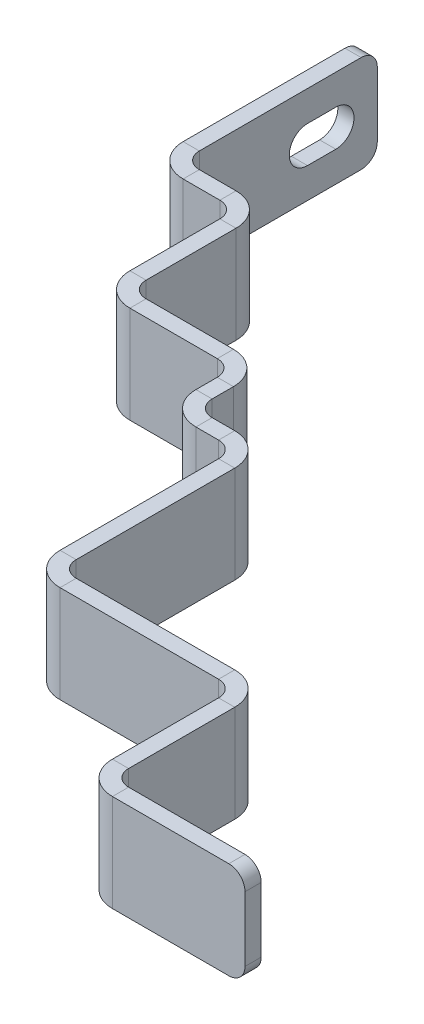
ISO-10303-21;
HEADER;
FILE_DESCRIPTION(('STEP AP214'),'2;1');
FILE_NAME('part.step','',(''),(''),'','','');
FILE_SCHEMA(('AUTOMOTIVE_DESIGN { 1 0 10303 214 1 1 1 1 }'));
ENDSEC;
DATA;
#1=APPLICATION_CONTEXT('core data for automotive mechanical design processes');
#2=APPLICATION_PROTOCOL_DEFINITION('international standard','automotive_design',2000,#1);
#3=PRODUCT_CONTEXT('',#1,'mechanical');
#4=PRODUCT('Part','Part','',(#3));
#5=PRODUCT_RELATED_PRODUCT_CATEGORY('part','',(#4));
#6=PRODUCT_DEFINITION_FORMATION('','',#4);
#7=PRODUCT_DEFINITION_CONTEXT('part definition',#1,'design');
#8=PRODUCT_DEFINITION('design','',#6,#7);
#9=PRODUCT_DEFINITION_SHAPE('','',#8);
#10=(LENGTH_UNIT() NAMED_UNIT(*) SI_UNIT(.MILLI.,.METRE.));
#11=(NAMED_UNIT(*) PLANE_ANGLE_UNIT() SI_UNIT($,.RADIAN.));
#12=(NAMED_UNIT(*) SI_UNIT($,.STERADIAN.) SOLID_ANGLE_UNIT());
#13=UNCERTAINTY_MEASURE_WITH_UNIT(LENGTH_MEASURE(1.E-05),#10,'distance_accuracy_value','');
#14=(GEOMETRIC_REPRESENTATION_CONTEXT(3) GLOBAL_UNCERTAINTY_ASSIGNED_CONTEXT((#13)) GLOBAL_UNIT_ASSIGNED_CONTEXT((#10,
#11,#12)) REPRESENTATION_CONTEXT('',''));
#15=CARTESIAN_POINT('',(0.,0.,0.));
#16=DIRECTION('',(0.,0.,1.));
#17=DIRECTION('',(1.,0.,0.));
#18=AXIS2_PLACEMENT_3D('',#15,#16,#17);
#19=CARTESIAN_POINT('',(-100.63732603,9.52499999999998,-115.062));
#20=DIRECTION('',(0.,-1.,0.));
#21=DIRECTION('',(0.,0.,-1.));
#22=AXIS2_PLACEMENT_3D('',#19,#20,#21);
#23=PLANE('',#22);
#24=DIRECTION('',(0.,0.,1.));
#25=VECTOR('',#24,1.);
#26=CARTESIAN_POINT('',(-111.017804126,9.52499999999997,-115.062));
#27=LINE('',#26,#25);
#28=CARTESIAN_POINT('',(-111.017804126,9.52499999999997,-115.062));
#29=VERTEX_POINT('',#28);
#30=CARTESIAN_POINT('',(-111.017804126,9.52499999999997,-111.887));
#31=VERTEX_POINT('',#30);
#32=EDGE_CURVE('E599',#29,#31,#27,.T.);
#33=ORIENTED_EDGE('',*,*,#32,.T.);
#34=DIRECTION('',(-1.,0.,0.));
#35=VECTOR('',#34,1.);
#36=CARTESIAN_POINT('',(-100.63732603,9.52499999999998,-111.887));
#37=LINE('',#36,#35);
#38=CARTESIAN_POINT('',(-103.81232603,9.52499999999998,-111.887));
#39=VERTEX_POINT('',#38);
#40=EDGE_CURVE('E624',#31,#39,#37,.F.);
#41=ORIENTED_EDGE('',*,*,#40,.T.);
#42=DIRECTION('',(0.,0.,1.));
#43=VECTOR('',#42,1.);
#44=CARTESIAN_POINT('',(-103.81232603,9.52499999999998,-115.062));
#45=LINE('',#44,#43);
#46=CARTESIAN_POINT('',(-103.81232603,9.52499999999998,-115.062));
#47=VERTEX_POINT('',#46);
#48=EDGE_CURVE('E612',#39,#47,#45,.F.);
#49=ORIENTED_EDGE('',*,*,#48,.T.);
#50=DIRECTION('',(1.,0.,0.));
#51=VECTOR('',#50,1.);
#52=CARTESIAN_POINT('',(0.,9.52499999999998,-115.062));
#53=LINE('',#52,#51);
#54=EDGE_CURVE('E619',#29,#47,#53,.T.);
#55=ORIENTED_EDGE('',*,*,#54,.F.);
#56=EDGE_LOOP('',(#33,#41,#49,#55));
#57=FACE_BOUND('',#56,.T.);
#58=ADVANCED_FACE('F232',(#57),#23,.F.);
#59=CARTESIAN_POINT('',(-114.192804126,-9.52499999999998,-115.062));
#60=DIRECTION('',(0.,1.,0.));
#61=DIRECTION('',(-1.,0.,0.));
#62=AXIS2_PLACEMENT_3D('',#59,#60,#61);
#63=PLANE('',#62);
#64=DIRECTION('',(0.,0.,1.));
#65=VECTOR('',#64,1.);
#66=CARTESIAN_POINT('',(-111.017804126,-9.52499999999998,-115.062));
#67=LINE('',#66,#65);
#68=CARTESIAN_POINT('',(-111.017804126,-9.52499999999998,-115.062));
#69=VERTEX_POINT('',#68);
#70=CARTESIAN_POINT('',(-111.017804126,-9.52499999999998,-111.887));
#71=VERTEX_POINT('',#70);
#72=EDGE_CURVE('E609',#69,#71,#67,.T.);
#73=ORIENTED_EDGE('',*,*,#72,.F.);
#74=DIRECTION('',(-1.,0.,0.));
#75=VECTOR('',#74,1.);
#76=CARTESIAN_POINT('',(0.,-9.52499999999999,-115.062));
#77=LINE('',#76,#75);
#78=CARTESIAN_POINT('',(-103.81232603,-9.52499999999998,-115.062));
#79=VERTEX_POINT('',#78);
#80=EDGE_CURVE('E615',#79,#69,#77,.T.);
#81=ORIENTED_EDGE('',*,*,#80,.F.);
#82=DIRECTION('',(0.,0.,1.));
#83=VECTOR('',#82,1.);
#84=CARTESIAN_POINT('',(-103.81232603,-9.52499999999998,-111.887));
#85=LINE('',#84,#83);
#86=CARTESIAN_POINT('',(-103.81232603,-9.52499999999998,-111.887));
#87=VERTEX_POINT('',#86);
#88=EDGE_CURVE('E629',#87,#79,#85,.F.);
#89=ORIENTED_EDGE('',*,*,#88,.F.);
#90=DIRECTION('',(1.,0.,0.));
#91=VECTOR('',#90,1.);
#92=CARTESIAN_POINT('',(-114.192804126,-9.52499999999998,-111.887));
#93=LINE('',#92,#91);
#94=EDGE_CURVE('E621',#87,#71,#93,.F.);
#95=ORIENTED_EDGE('',*,*,#94,.T.);
#96=EDGE_LOOP('',(#73,#81,#89,#95));
#97=FACE_BOUND('',#96,.T.);
#98=ADVANCED_FACE('F1071',(#97),#63,.F.);
#99=CARTESIAN_POINT('',(0.,0.,-115.062));
#100=DIRECTION('',(0.,0.,1.));
#101=DIRECTION('',(1.,0.,0.));
#102=AXIS2_PLACEMENT_3D('',#99,#100,#101);
#103=PLANE('',#102);
#104=DIRECTION('',(0.,1.,0.));
#105=VECTOR('',#104,1.);
#106=CARTESIAN_POINT('',(-111.017804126,9.52499999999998,-115.062));
#107=LINE('',#106,#105);
#108=EDGE_CURVE('E605',#29,#69,#107,.F.);
#109=ORIENTED_EDGE('',*,*,#108,.F.);
#110=ORIENTED_EDGE('',*,*,#54,.T.);
#111=DIRECTION('',(0.,-1.,0.));
#112=VECTOR('',#111,1.);
#113=CARTESIAN_POINT('',(-103.81232603,9.52499999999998,-115.062));
#114=LINE('',#113,#112);
#115=EDGE_CURVE('E626',#79,#47,#114,.F.);
#116=ORIENTED_EDGE('',*,*,#115,.F.);
#117=ORIENTED_EDGE('',*,*,#80,.T.);
#118=EDGE_LOOP('',(#109,#110,#116,#117));
#119=FACE_BOUND('',#118,.T.);
#120=ADVANCED_FACE('F1051',(#119),#103,.F.);
#121=CARTESIAN_POINT('',(0.,0.,-111.887));
#122=DIRECTION('',(0.,0.,1.));
#123=DIRECTION('',(1.,0.,0.));
#124=AXIS2_PLACEMENT_3D('',#121,#122,#123);
#125=PLANE('',#124);
#126=ORIENTED_EDGE('',*,*,#40,.F.);
#127=DIRECTION('',(0.,1.,0.));
#128=VECTOR('',#127,1.);
#129=CARTESIAN_POINT('',(-111.017804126,9.52499999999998,-111.887));
#130=LINE('',#129,#128);
#131=EDGE_CURVE('E592',#31,#71,#130,.F.);
#132=ORIENTED_EDGE('',*,*,#131,.T.);
#133=ORIENTED_EDGE('',*,*,#94,.F.);
#134=DIRECTION('',(0.,-1.,0.));
#135=VECTOR('',#134,1.);
#136=CARTESIAN_POINT('',(-103.81232603,9.52499999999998,-111.887));
#137=LINE('',#136,#135);
#138=EDGE_CURVE('E632',#39,#87,#137,.T.);
#139=ORIENTED_EDGE('',*,*,#138,.F.);
#140=EDGE_LOOP('',(#126,#132,#133,#139));
#141=FACE_BOUND('',#140,.T.);
#142=ADVANCED_FACE('F1068',(#141),#125,.T.);
#143=CARTESIAN_POINT('',(-100.63732603,-9.52499999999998,-87.884));
#144=DIRECTION('',(0.,1.,0.));
#145=DIRECTION('',(0.,0.,1.));
#146=AXIS2_PLACEMENT_3D('',#143,#144,#145);
#147=PLANE('',#146);
#148=DIRECTION('',(1.,0.,0.));
#149=VECTOR('',#148,1.);
#150=CARTESIAN_POINT('',(-100.63732603,-9.52499999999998,-108.712));
#151=LINE('',#150,#149);
#152=CARTESIAN_POINT('',(-100.63732603,-9.52499999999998,-108.712));
#153=VERTEX_POINT('',#152);
#154=CARTESIAN_POINT('',(-97.4623260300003,-9.52499999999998,-108.712));
#155=VERTEX_POINT('',#154);
#156=EDGE_CURVE('E643',#153,#155,#151,.T.);
#157=ORIENTED_EDGE('',*,*,#156,.T.);
#158=DIRECTION('',(0.,0.,1.));
#159=VECTOR('',#158,1.);
#160=CARTESIAN_POINT('',(-97.4623260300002,-9.52499999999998,-87.884));
#161=LINE('',#160,#159);
#162=CARTESIAN_POINT('',(-97.4623260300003,-9.52499999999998,-91.0589999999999));
#163=VERTEX_POINT('',#162);
#164=EDGE_CURVE('E669',#155,#163,#161,.T.);
#165=ORIENTED_EDGE('',*,*,#164,.T.);
#166=DIRECTION('',(-1.,0.,0.));
#167=VECTOR('',#166,1.);
#168=CARTESIAN_POINT('',(-97.4623260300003,-9.52499999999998,-91.0589999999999));
#169=LINE('',#168,#167);
#170=CARTESIAN_POINT('',(-100.63732603,-9.52499999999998,-91.0589999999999));
#171=VERTEX_POINT('',#170);
#172=EDGE_CURVE('E656',#163,#171,#169,.T.);
#173=ORIENTED_EDGE('',*,*,#172,.T.);
#174=DIRECTION('',(0.,0.,1.));
#175=VECTOR('',#174,1.);
#176=CARTESIAN_POINT('',(-100.63732603,-9.52499999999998,-87.884));
#177=LINE('',#176,#175);
#178=EDGE_CURVE('E670',#153,#171,#177,.T.);
#179=ORIENTED_EDGE('',*,*,#178,.F.);
#180=EDGE_LOOP('',(#157,#165,#173,#179));
#181=FACE_BOUND('',#180,.T.);
#182=ADVANCED_FACE('F1100',(#181),#147,.F.);
#183=CARTESIAN_POINT('',(-100.63732603,9.52499999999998,-115.062));
#184=DIRECTION('',(0.,-1.,0.));
#185=DIRECTION('',(0.,0.,-1.));
#186=AXIS2_PLACEMENT_3D('',#183,#184,#185);
#187=PLANE('',#186);
#188=DIRECTION('',(1.,0.,0.));
#189=VECTOR('',#188,1.);
#190=CARTESIAN_POINT('',(-100.63732603,9.52499999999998,-108.712));
#191=LINE('',#190,#189);
#192=CARTESIAN_POINT('',(-100.63732603,9.52499999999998,-108.712));
#193=VERTEX_POINT('',#192);
#194=CARTESIAN_POINT('',(-97.4623260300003,9.52499999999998,-108.712));
#195=VERTEX_POINT('',#194);
#196=EDGE_CURVE('E653',#193,#195,#191,.T.);
#197=ORIENTED_EDGE('',*,*,#196,.F.);
#198=DIRECTION('',(0.,0.,-1.));
#199=VECTOR('',#198,1.);
#200=CARTESIAN_POINT('',(-100.63732603,9.52499999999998,-115.062));
#201=LINE('',#200,#199);
#202=CARTESIAN_POINT('',(-100.63732603,9.52499999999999,-91.0589999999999));
#203=VERTEX_POINT('',#202);
#204=EDGE_CURVE('E672',#203,#193,#201,.T.);
#205=ORIENTED_EDGE('',*,*,#204,.F.);
#206=DIRECTION('',(-1.,0.,0.));
#207=VECTOR('',#206,1.);
#208=CARTESIAN_POINT('',(-97.4623260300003,9.52499999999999,-91.0589999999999));
#209=LINE('',#208,#207);
#210=CARTESIAN_POINT('',(-97.4623260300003,9.52499999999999,-91.0589999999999));
#211=VERTEX_POINT('',#210);
#212=EDGE_CURVE('E661',#211,#203,#209,.T.);
#213=ORIENTED_EDGE('',*,*,#212,.F.);
#214=DIRECTION('',(0.,0.,-1.));
#215=VECTOR('',#214,1.);
#216=CARTESIAN_POINT('',(-97.4623260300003,9.52499999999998,-115.062));
#217=LINE('',#216,#215);
#218=EDGE_CURVE('E673',#211,#195,#217,.T.);
#219=ORIENTED_EDGE('',*,*,#218,.T.);
#220=EDGE_LOOP('',(#197,#205,#213,#219));
#221=FACE_BOUND('',#220,.T.);
#222=ADVANCED_FACE('F1083',(#221),#187,.F.);
#223=CARTESIAN_POINT('',(-100.63732603,0.,3.07810741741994E-13));
#224=DIRECTION('',(1.,0.,0.));
#225=DIRECTION('',(0.,0.,-1.));
#226=AXIS2_PLACEMENT_3D('',#223,#224,#225);
#227=PLANE('',#226);
#228=DIRECTION('',(0.,-1.,0.));
#229=VECTOR('',#228,1.);
#230=CARTESIAN_POINT('',(-100.63732603,-9.52499999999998,-108.712));
#231=LINE('',#230,#229);
#232=EDGE_CURVE('E649',#153,#193,#231,.F.);
#233=ORIENTED_EDGE('',*,*,#232,.F.);
#234=ORIENTED_EDGE('',*,*,#178,.T.);
#235=DIRECTION('',(0.,-1.,0.));
#236=VECTOR('',#235,1.);
#237=CARTESIAN_POINT('',(-100.63732603,0.,-91.0589999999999));
#238=LINE('',#237,#236);
#239=EDGE_CURVE('E664',#203,#171,#238,.T.);
#240=ORIENTED_EDGE('',*,*,#239,.F.);
#241=ORIENTED_EDGE('',*,*,#204,.T.);
#242=EDGE_LOOP('',(#233,#234,#240,#241));
#243=FACE_BOUND('',#242,.T.);
#244=ADVANCED_FACE('F1090',(#243),#227,.F.);
#245=CARTESIAN_POINT('',(-97.46232603,0.,2.98600665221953E-13));
#246=DIRECTION('',(1.,0.,0.));
#247=DIRECTION('',(0.,0.,-1.));
#248=AXIS2_PLACEMENT_3D('',#245,#246,#247);
#249=PLANE('',#248);
#250=ORIENTED_EDGE('',*,*,#164,.F.);
#251=DIRECTION('',(0.,-1.,0.));
#252=VECTOR('',#251,1.);
#253=CARTESIAN_POINT('',(-97.4623260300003,-9.52499999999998,-108.712));
#254=LINE('',#253,#252);
#255=EDGE_CURVE('E636',#155,#195,#254,.F.);
#256=ORIENTED_EDGE('',*,*,#255,.T.);
#257=ORIENTED_EDGE('',*,*,#218,.F.);
#258=DIRECTION('',(0.,1.,0.));
#259=VECTOR('',#258,1.);
#260=CARTESIAN_POINT('',(-97.4623260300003,-9.52499999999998,-91.0589999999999));
#261=LINE('',#260,#259);
#262=EDGE_CURVE('E659',#163,#211,#261,.T.);
#263=ORIENTED_EDGE('',*,*,#262,.F.);
#264=EDGE_LOOP('',(#250,#256,#257,#263));
#265=FACE_BOUND('',#264,.T.);
#266=ADVANCED_FACE('F1079',(#265),#249,.T.);
#267=CARTESIAN_POINT('',(-73.9673260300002,9.52499999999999,-87.884));
#268=DIRECTION('',(0.,-1.,0.));
#269=DIRECTION('',(0.,0.,-1.));
#270=AXIS2_PLACEMENT_3D('',#267,#268,#269);
#271=PLANE('',#270);
#272=DIRECTION('',(0.,0.,1.));
#273=VECTOR('',#272,1.);
#274=CARTESIAN_POINT('',(-94.2873260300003,9.52499999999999,-87.884));
#275=LINE('',#274,#273);
#276=CARTESIAN_POINT('',(-94.2873260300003,9.52499999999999,-87.884));
#277=VERTEX_POINT('',#276);
#278=CARTESIAN_POINT('',(-94.2873260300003,9.52499999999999,-84.709));
#279=VERTEX_POINT('',#278);
#280=EDGE_CURVE('E687',#277,#279,#275,.T.);
#281=ORIENTED_EDGE('',*,*,#280,.T.);
#282=DIRECTION('',(-1.,0.,0.));
#283=VECTOR('',#282,1.);
#284=CARTESIAN_POINT('',(-73.9673260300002,9.52499999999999,-84.709));
#285=LINE('',#284,#283);
#286=CARTESIAN_POINT('',(-77.1423260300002,9.52499999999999,-84.709));
#287=VERTEX_POINT('',#286);
#288=EDGE_CURVE('E712',#279,#287,#285,.F.);
#289=ORIENTED_EDGE('',*,*,#288,.T.);
#290=DIRECTION('',(0.,0.,1.));
#291=VECTOR('',#290,1.);
#292=CARTESIAN_POINT('',(-77.1423260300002,9.52499999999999,-87.884));
#293=LINE('',#292,#291);
#294=CARTESIAN_POINT('',(-77.1423260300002,9.52499999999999,-87.884));
#295=VERTEX_POINT('',#294);
#296=EDGE_CURVE('E700',#287,#295,#293,.F.);
#297=ORIENTED_EDGE('',*,*,#296,.T.);
#298=DIRECTION('',(1.,0.,0.));
#299=VECTOR('',#298,1.);
#300=CARTESIAN_POINT('',(0.,9.52499999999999,-87.8839999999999));
#301=LINE('',#300,#299);
#302=EDGE_CURVE('E707',#277,#295,#301,.T.);
#303=ORIENTED_EDGE('',*,*,#302,.F.);
#304=EDGE_LOOP('',(#281,#289,#297,#303));
#305=FACE_BOUND('',#304,.T.);
#306=ADVANCED_FACE('F1129',(#305),#271,.F.);
#307=CARTESIAN_POINT('',(-97.4623260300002,-9.52499999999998,-87.884));
#308=DIRECTION('',(0.,1.,0.));
#309=DIRECTION('',(-1.,0.,0.));
#310=AXIS2_PLACEMENT_3D('',#307,#308,#309);
#311=PLANE('',#310);
#312=DIRECTION('',(0.,0.,1.));
#313=VECTOR('',#312,1.);
#314=CARTESIAN_POINT('',(-94.2873260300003,-9.52499999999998,-87.884));
#315=LINE('',#314,#313);
#316=CARTESIAN_POINT('',(-94.2873260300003,-9.52499999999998,-87.884));
#317=VERTEX_POINT('',#316);
#318=CARTESIAN_POINT('',(-94.2873260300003,-9.52499999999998,-84.709));
#319=VERTEX_POINT('',#318);
#320=EDGE_CURVE('E697',#317,#319,#315,.T.);
#321=ORIENTED_EDGE('',*,*,#320,.F.);
#322=DIRECTION('',(-1.,0.,0.));
#323=VECTOR('',#322,1.);
#324=CARTESIAN_POINT('',(0.,-9.52499999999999,-87.8839999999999));
#325=LINE('',#324,#323);
#326=CARTESIAN_POINT('',(-77.1423260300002,-9.52499999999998,-87.884));
#327=VERTEX_POINT('',#326);
#328=EDGE_CURVE('E703',#327,#317,#325,.T.);
#329=ORIENTED_EDGE('',*,*,#328,.F.);
#330=DIRECTION('',(0.,0.,1.));
#331=VECTOR('',#330,1.);
#332=CARTESIAN_POINT('',(-77.1423260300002,-9.52499999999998,-84.709));
#333=LINE('',#332,#331);
#334=CARTESIAN_POINT('',(-77.1423260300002,-9.52499999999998,-84.709));
#335=VERTEX_POINT('',#334);
#336=EDGE_CURVE('E717',#335,#327,#333,.F.);
#337=ORIENTED_EDGE('',*,*,#336,.F.);
#338=DIRECTION('',(1.,0.,0.));
#339=VECTOR('',#338,1.);
#340=CARTESIAN_POINT('',(-97.4623260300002,-9.52499999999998,-84.709));
#341=LINE('',#340,#339);
#342=EDGE_CURVE('E709',#335,#319,#341,.F.);
#343=ORIENTED_EDGE('',*,*,#342,.T.);
#344=EDGE_LOOP('',(#321,#329,#337,#343));
#345=FACE_BOUND('',#344,.T.);
#346=ADVANCED_FACE('F1133',(#345),#311,.F.);
#347=CARTESIAN_POINT('',(0.,0.,-87.8839999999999));
#348=DIRECTION('',(0.,0.,1.));
#349=DIRECTION('',(1.,0.,0.));
#350=AXIS2_PLACEMENT_3D('',#347,#348,#349);
#351=PLANE('',#350);
#352=DIRECTION('',(0.,1.,0.));
#353=VECTOR('',#352,1.);
#354=CARTESIAN_POINT('',(-94.2873260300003,9.52499999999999,-87.884));
#355=LINE('',#354,#353);
#356=EDGE_CURVE('E693',#277,#317,#355,.F.);
#357=ORIENTED_EDGE('',*,*,#356,.F.);
#358=ORIENTED_EDGE('',*,*,#302,.T.);
#359=DIRECTION('',(0.,-1.,0.));
#360=VECTOR('',#359,1.);
#361=CARTESIAN_POINT('',(-77.1423260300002,9.52499999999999,-87.884));
#362=LINE('',#361,#360);
#363=EDGE_CURVE('E714',#327,#295,#362,.F.);
#364=ORIENTED_EDGE('',*,*,#363,.F.);
#365=ORIENTED_EDGE('',*,*,#328,.T.);
#366=EDGE_LOOP('',(#357,#358,#364,#365));
#367=FACE_BOUND('',#366,.T.);
#368=ADVANCED_FACE('F1139',(#367),#351,.F.);
#369=CARTESIAN_POINT('',(0.,0.,-84.7089999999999));
#370=DIRECTION('',(0.,0.,1.));
#371=DIRECTION('',(1.,0.,0.));
#372=AXIS2_PLACEMENT_3D('',#369,#370,#371);
#373=PLANE('',#372);
#374=ORIENTED_EDGE('',*,*,#288,.F.);
#375=DIRECTION('',(0.,1.,0.));
#376=VECTOR('',#375,1.);
#377=CARTESIAN_POINT('',(-94.2873260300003,9.52499999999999,-84.709));
#378=LINE('',#377,#376);
#379=EDGE_CURVE('E680',#279,#319,#378,.F.);
#380=ORIENTED_EDGE('',*,*,#379,.T.);
#381=ORIENTED_EDGE('',*,*,#342,.F.);
#382=DIRECTION('',(0.,-1.,0.));
#383=VECTOR('',#382,1.);
#384=CARTESIAN_POINT('',(-77.1423260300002,9.52499999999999,-84.709));
#385=LINE('',#384,#383);
#386=EDGE_CURVE('E720',#287,#335,#385,.T.);
#387=ORIENTED_EDGE('',*,*,#386,.F.);
#388=EDGE_LOOP('',(#374,#380,#381,#387));
#389=FACE_BOUND('',#388,.T.);
#390=ADVANCED_FACE('F1177',(#389),#373,.T.);
#391=CARTESIAN_POINT('',(-73.9673260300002,-9.52499999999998,-74.1679999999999));
#392=DIRECTION('',(0.,1.,0.));
#393=DIRECTION('',(0.,0.,1.));
#394=AXIS2_PLACEMENT_3D('',#391,#392,#393);
#395=PLANE('',#394);
#396=DIRECTION('',(1.,0.,0.));
#397=VECTOR('',#396,1.);
#398=CARTESIAN_POINT('',(-73.9673260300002,-9.52499999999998,-81.534));
#399=LINE('',#398,#397);
#400=CARTESIAN_POINT('',(-73.9673260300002,-9.52499999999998,-81.534));
#401=VERTEX_POINT('',#400);
#402=CARTESIAN_POINT('',(-70.7923260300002,-9.52499999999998,-81.534));
#403=VERTEX_POINT('',#402);
#404=EDGE_CURVE('E731',#401,#403,#399,.T.);
#405=ORIENTED_EDGE('',*,*,#404,.T.);
#406=DIRECTION('',(0.,0.,1.));
#407=VECTOR('',#406,1.);
#408=CARTESIAN_POINT('',(-70.7923260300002,-9.52499999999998,-74.168));
#409=LINE('',#408,#407);
#410=CARTESIAN_POINT('',(-70.7923260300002,-9.52499999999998,-77.3429999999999));
#411=VERTEX_POINT('',#410);
#412=EDGE_CURVE('E757',#403,#411,#409,.T.);
#413=ORIENTED_EDGE('',*,*,#412,.T.);
#414=DIRECTION('',(-1.,0.,0.));
#415=VECTOR('',#414,1.);
#416=CARTESIAN_POINT('',(-70.7923260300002,-9.52499999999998,-77.3429999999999));
#417=LINE('',#416,#415);
#418=CARTESIAN_POINT('',(-73.9673260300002,-9.52499999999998,-77.3429999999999));
#419=VERTEX_POINT('',#418);
#420=EDGE_CURVE('E744',#411,#419,#417,.T.);
#421=ORIENTED_EDGE('',*,*,#420,.T.);
#422=DIRECTION('',(0.,0.,1.));
#423=VECTOR('',#422,1.);
#424=CARTESIAN_POINT('',(-73.9673260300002,-9.52499999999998,-74.1679999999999));
#425=LINE('',#424,#423);
#426=EDGE_CURVE('E758',#401,#419,#425,.T.);
#427=ORIENTED_EDGE('',*,*,#426,.F.);
#428=EDGE_LOOP('',(#405,#413,#421,#427));
#429=FACE_BOUND('',#428,.T.);
#430=ADVANCED_FACE('F1173',(#429),#395,.F.);
#431=CARTESIAN_POINT('',(-73.9673260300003,9.52499999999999,-87.884));
#432=DIRECTION('',(0.,-1.,0.));
#433=DIRECTION('',(0.,0.,-1.));
#434=AXIS2_PLACEMENT_3D('',#431,#432,#433);
#435=PLANE('',#434);
#436=DIRECTION('',(1.,0.,0.));
#437=VECTOR('',#436,1.);
#438=CARTESIAN_POINT('',(-73.9673260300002,9.52499999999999,-81.534));
#439=LINE('',#438,#437);
#440=CARTESIAN_POINT('',(-73.9673260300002,9.52499999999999,-81.534));
#441=VERTEX_POINT('',#440);
#442=CARTESIAN_POINT('',(-70.7923260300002,9.52499999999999,-81.534));
#443=VERTEX_POINT('',#442);
#444=EDGE_CURVE('E741',#441,#443,#439,.T.);
#445=ORIENTED_EDGE('',*,*,#444,.F.);
#446=DIRECTION('',(0.,0.,-1.));
#447=VECTOR('',#446,1.);
#448=CARTESIAN_POINT('',(-73.9673260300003,9.52499999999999,-87.884));
#449=LINE('',#448,#447);
#450=CARTESIAN_POINT('',(-73.9673260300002,9.52499999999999,-77.3429999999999));
#451=VERTEX_POINT('',#450);
#452=EDGE_CURVE('E760',#451,#441,#449,.T.);
#453=ORIENTED_EDGE('',*,*,#452,.F.);
#454=DIRECTION('',(-1.,0.,0.));
#455=VECTOR('',#454,1.);
#456=CARTESIAN_POINT('',(-70.7923260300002,9.52499999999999,-77.3429999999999));
#457=LINE('',#456,#455);
#458=CARTESIAN_POINT('',(-70.7923260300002,9.52499999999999,-77.3429999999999));
#459=VERTEX_POINT('',#458);
#460=EDGE_CURVE('E749',#459,#451,#457,.T.);
#461=ORIENTED_EDGE('',*,*,#460,.F.);
#462=DIRECTION('',(0.,0.,-1.));
#463=VECTOR('',#462,1.);
#464=CARTESIAN_POINT('',(-70.7923260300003,9.52499999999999,-87.884));
#465=LINE('',#464,#463);
#466=EDGE_CURVE('E761',#459,#443,#465,.T.);
#467=ORIENTED_EDGE('',*,*,#466,.T.);
#468=EDGE_LOOP('',(#445,#453,#461,#467));
#469=FACE_BOUND('',#468,.T.);
#470=ADVANCED_FACE('F1165',(#469),#435,.F.);
#471=CARTESIAN_POINT('',(-73.96732603,0.,2.25967535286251E-13));
#472=DIRECTION('',(1.,0.,0.));
#473=DIRECTION('',(0.,0.,-1.));
#474=AXIS2_PLACEMENT_3D('',#471,#472,#473);
#475=PLANE('',#474);
#476=DIRECTION('',(0.,-1.,0.));
#477=VECTOR('',#476,1.);
#478=CARTESIAN_POINT('',(-73.9673260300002,-9.52499999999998,-81.534));
#479=LINE('',#478,#477);
#480=EDGE_CURVE('E737',#401,#441,#479,.F.);
#481=ORIENTED_EDGE('',*,*,#480,.F.);
#482=ORIENTED_EDGE('',*,*,#426,.T.);
#483=DIRECTION('',(0.,-1.,0.));
#484=VECTOR('',#483,1.);
#485=CARTESIAN_POINT('',(-73.9673260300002,0.,-77.3429999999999));
#486=LINE('',#485,#484);
#487=EDGE_CURVE('E752',#451,#419,#486,.T.);
#488=ORIENTED_EDGE('',*,*,#487,.F.);
#489=ORIENTED_EDGE('',*,*,#452,.T.);
#490=EDGE_LOOP('',(#481,#482,#488,#489));
#491=FACE_BOUND('',#490,.T.);
#492=ADVANCED_FACE('F1161',(#491),#475,.F.);
#493=CARTESIAN_POINT('',(-70.79232603,0.,2.14882082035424E-13));
#494=DIRECTION('',(1.,0.,0.));
#495=DIRECTION('',(0.,0.,-1.));
#496=AXIS2_PLACEMENT_3D('',#493,#494,#495);
#497=PLANE('',#496);
#498=ORIENTED_EDGE('',*,*,#412,.F.);
#499=DIRECTION('',(0.,-1.,0.));
#500=VECTOR('',#499,1.);
#501=CARTESIAN_POINT('',(-70.7923260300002,-9.52499999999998,-81.534));
#502=LINE('',#501,#500);
#503=EDGE_CURVE('E724',#403,#443,#502,.F.);
#504=ORIENTED_EDGE('',*,*,#503,.T.);
#505=ORIENTED_EDGE('',*,*,#466,.F.);
#506=DIRECTION('',(0.,1.,0.));
#507=VECTOR('',#506,1.);
#508=CARTESIAN_POINT('',(-70.7923260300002,-9.52499999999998,-77.3429999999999));
#509=LINE('',#508,#507);
#510=EDGE_CURVE('E747',#411,#459,#509,.T.);
#511=ORIENTED_EDGE('',*,*,#510,.F.);
#512=EDGE_LOOP('',(#498,#504,#505,#511));
#513=FACE_BOUND('',#512,.T.);
#514=ADVANCED_FACE('F1164',(#513),#497,.T.);
#515=CARTESIAN_POINT('',(-59.9973260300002,9.52499999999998,-74.168));
#516=DIRECTION('',(0.,-1.,0.));
#517=DIRECTION('',(1.,0.,0.));
#518=AXIS2_PLACEMENT_3D('',#515,#516,#517);
#519=PLANE('',#518);
#520=DIRECTION('',(0.,0.,1.));
#521=VECTOR('',#520,1.);
#522=CARTESIAN_POINT('',(-67.6173260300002,9.52499999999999,-74.168));
#523=LINE('',#522,#521);
#524=CARTESIAN_POINT('',(-67.6173260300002,9.52499999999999,-74.168));
#525=VERTEX_POINT('',#524);
#526=CARTESIAN_POINT('',(-67.6173260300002,9.52499999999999,-70.993));
#527=VERTEX_POINT('',#526);
#528=EDGE_CURVE('E775',#525,#527,#523,.T.);
#529=ORIENTED_EDGE('',*,*,#528,.T.);
#530=DIRECTION('',(-1.,0.,0.));
#531=VECTOR('',#530,1.);
#532=CARTESIAN_POINT('',(-59.9973260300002,9.52499999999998,-70.993));
#533=LINE('',#532,#531);
#534=CARTESIAN_POINT('',(-63.1723260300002,9.52499999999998,-70.993));
#535=VERTEX_POINT('',#534);
#536=EDGE_CURVE('E800',#527,#535,#533,.F.);
#537=ORIENTED_EDGE('',*,*,#536,.T.);
#538=DIRECTION('',(0.,0.,1.));
#539=VECTOR('',#538,1.);
#540=CARTESIAN_POINT('',(-63.1723260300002,9.52499999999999,-74.168));
#541=LINE('',#540,#539);
#542=CARTESIAN_POINT('',(-63.1723260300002,9.52499999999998,-74.168));
#543=VERTEX_POINT('',#542);
#544=EDGE_CURVE('E788',#535,#543,#541,.F.);
#545=ORIENTED_EDGE('',*,*,#544,.T.);
#546=DIRECTION('',(1.,0.,0.));
#547=VECTOR('',#546,1.);
#548=CARTESIAN_POINT('',(0.,9.52499999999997,-74.168));
#549=LINE('',#548,#547);
#550=EDGE_CURVE('E795',#525,#543,#549,.T.);
#551=ORIENTED_EDGE('',*,*,#550,.F.);
#552=EDGE_LOOP('',(#529,#537,#545,#551));
#553=FACE_BOUND('',#552,.T.);
#554=ADVANCED_FACE('F1169',(#553),#519,.F.);
#555=CARTESIAN_POINT('',(-70.7923260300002,-9.52499999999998,-74.168));
#556=DIRECTION('',(0.,1.,0.));
#557=DIRECTION('',(-1.,0.,0.));
#558=AXIS2_PLACEMENT_3D('',#555,#556,#557);
#559=PLANE('',#558);
#560=DIRECTION('',(0.,0.,1.));
#561=VECTOR('',#560,1.);
#562=CARTESIAN_POINT('',(-67.6173260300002,-9.52499999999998,-74.168));
#563=LINE('',#562,#561);
#564=CARTESIAN_POINT('',(-67.6173260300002,-9.52499999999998,-74.168));
#565=VERTEX_POINT('',#564);
#566=CARTESIAN_POINT('',(-67.6173260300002,-9.52499999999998,-70.993));
#567=VERTEX_POINT('',#566);
#568=EDGE_CURVE('E785',#565,#567,#563,.T.);
#569=ORIENTED_EDGE('',*,*,#568,.F.);
#570=DIRECTION('',(-1.,0.,0.));
#571=VECTOR('',#570,1.);
#572=CARTESIAN_POINT('',(0.,-9.52500000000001,-74.168));
#573=LINE('',#572,#571);
#574=CARTESIAN_POINT('',(-63.1723260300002,-9.52499999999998,-74.168));
#575=VERTEX_POINT('',#574);
#576=EDGE_CURVE('E791',#575,#565,#573,.T.);
#577=ORIENTED_EDGE('',*,*,#576,.F.);
#578=DIRECTION('',(0.,0.,1.));
#579=VECTOR('',#578,1.);
#580=CARTESIAN_POINT('',(-63.1723260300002,-9.52499999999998,-70.993));
#581=LINE('',#580,#579);
#582=CARTESIAN_POINT('',(-63.1723260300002,-9.52499999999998,-70.993));
#583=VERTEX_POINT('',#582);
#584=EDGE_CURVE('E805',#583,#575,#581,.F.);
#585=ORIENTED_EDGE('',*,*,#584,.F.);
#586=DIRECTION('',(1.,0.,0.));
#587=VECTOR('',#586,1.);
#588=CARTESIAN_POINT('',(-70.7923260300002,-9.52499999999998,-70.993));
#589=LINE('',#588,#587);
#590=EDGE_CURVE('E797',#583,#567,#589,.F.);
#591=ORIENTED_EDGE('',*,*,#590,.T.);
#592=EDGE_LOOP('',(#569,#577,#585,#591));
#593=FACE_BOUND('',#592,.T.);
#594=ADVANCED_FACE('F1199',(#593),#559,.F.);
#595=CARTESIAN_POINT('',(0.,0.,-74.168));
#596=DIRECTION('',(0.,0.,1.));
#597=DIRECTION('',(1.,0.,0.));
#598=AXIS2_PLACEMENT_3D('',#595,#596,#597);
#599=PLANE('',#598);
#600=DIRECTION('',(0.,1.,0.));
#601=VECTOR('',#600,1.);
#602=CARTESIAN_POINT('',(-67.6173260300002,9.52499999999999,-74.168));
#603=LINE('',#602,#601);
#604=EDGE_CURVE('E781',#525,#565,#603,.F.);
#605=ORIENTED_EDGE('',*,*,#604,.F.);
#606=ORIENTED_EDGE('',*,*,#550,.T.);
#607=DIRECTION('',(0.,-1.,0.));
#608=VECTOR('',#607,1.);
#609=CARTESIAN_POINT('',(-63.1723260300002,9.52499999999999,-74.168));
#610=LINE('',#609,#608);
#611=EDGE_CURVE('E802',#575,#543,#610,.F.);
#612=ORIENTED_EDGE('',*,*,#611,.F.);
#613=ORIENTED_EDGE('',*,*,#576,.T.);
#614=EDGE_LOOP('',(#605,#606,#612,#613));
#615=FACE_BOUND('',#614,.T.);
#616=ADVANCED_FACE('F1195',(#615),#599,.F.);
#617=CARTESIAN_POINT('',(0.,0.,-70.993));
#618=DIRECTION('',(0.,0.,1.));
#619=DIRECTION('',(1.,0.,0.));
#620=AXIS2_PLACEMENT_3D('',#617,#618,#619);
#621=PLANE('',#620);
#622=ORIENTED_EDGE('',*,*,#536,.F.);
#623=DIRECTION('',(0.,1.,0.));
#624=VECTOR('',#623,1.);
#625=CARTESIAN_POINT('',(-67.6173260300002,9.52499999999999,-70.993));
#626=LINE('',#625,#624);
#627=EDGE_CURVE('E768',#527,#567,#626,.F.);
#628=ORIENTED_EDGE('',*,*,#627,.T.);
#629=ORIENTED_EDGE('',*,*,#590,.F.);
#630=DIRECTION('',(0.,-1.,0.));
#631=VECTOR('',#630,1.);
#632=CARTESIAN_POINT('',(-63.1723260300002,9.52499999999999,-70.993));
#633=LINE('',#632,#631);
#634=EDGE_CURVE('E808',#535,#583,#633,.T.);
#635=ORIENTED_EDGE('',*,*,#634,.F.);
#636=EDGE_LOOP('',(#622,#628,#629,#635));
#637=FACE_BOUND('',#636,.T.);
#638=ADVANCED_FACE('F1198',(#637),#621,.T.);
#639=CARTESIAN_POINT('',(-59.9973260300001,-9.52499999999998,-33.528));
#640=DIRECTION('',(0.,1.,0.));
#641=DIRECTION('',(-1.,0.,0.));
#642=AXIS2_PLACEMENT_3D('',#639,#640,#641);
#643=PLANE('',#642);
#644=DIRECTION('',(1.,0.,0.));
#645=VECTOR('',#644,1.);
#646=CARTESIAN_POINT('',(-59.9973260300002,-9.52499999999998,-67.818));
#647=LINE('',#646,#645);
#648=CARTESIAN_POINT('',(-59.9973260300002,-9.52499999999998,-67.818));
#649=VERTEX_POINT('',#648);
#650=CARTESIAN_POINT('',(-56.8223260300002,-9.52499999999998,-67.818));
#651=VERTEX_POINT('',#650);
#652=EDGE_CURVE('E819',#649,#651,#647,.T.);
#653=ORIENTED_EDGE('',*,*,#652,.T.);
#654=DIRECTION('',(0.,0.,-1.));
#655=VECTOR('',#654,1.);
#656=CARTESIAN_POINT('',(-56.8223260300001,-9.52499999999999,-33.528));
#657=LINE('',#656,#655);
#658=CARTESIAN_POINT('',(-56.8223260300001,-9.52499999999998,-36.703));
#659=VERTEX_POINT('',#658);
#660=EDGE_CURVE('E844',#651,#659,#657,.F.);
#661=ORIENTED_EDGE('',*,*,#660,.T.);
#662=DIRECTION('',(1.,0.,0.));
#663=VECTOR('',#662,1.);
#664=CARTESIAN_POINT('',(-59.9973260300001,-9.52499999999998,-36.703));
#665=LINE('',#664,#663);
#666=CARTESIAN_POINT('',(-59.9973260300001,-9.52499999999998,-36.703));
#667=VERTEX_POINT('',#666);
#668=EDGE_CURVE('E832',#659,#667,#665,.F.);
#669=ORIENTED_EDGE('',*,*,#668,.T.);
#670=DIRECTION('',(0.,0.,1.));
#671=VECTOR('',#670,1.);
#672=CARTESIAN_POINT('',(-59.99732603,-9.52499999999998,2.15964921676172E-13));
#673=LINE('',#672,#671);
#674=EDGE_CURVE('E839',#649,#667,#673,.T.);
#675=ORIENTED_EDGE('',*,*,#674,.F.);
#676=EDGE_LOOP('',(#653,#661,#669,#675));
#677=FACE_BOUND('',#676,.T.);
#678=ADVANCED_FACE('F1203',(#677),#643,.F.);
#679=CARTESIAN_POINT('',(-59.9973260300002,9.52499999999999,-74.168));
#680=DIRECTION('',(0.,-1.,0.));
#681=DIRECTION('',(1.,0.,0.));
#682=AXIS2_PLACEMENT_3D('',#679,#680,#681);
#683=PLANE('',#682);
#684=DIRECTION('',(1.,0.,0.));
#685=VECTOR('',#684,1.);
#686=CARTESIAN_POINT('',(-59.9973260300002,9.52499999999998,-67.818));
#687=LINE('',#686,#685);
#688=CARTESIAN_POINT('',(-59.9973260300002,9.52499999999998,-67.818));
#689=VERTEX_POINT('',#688);
#690=CARTESIAN_POINT('',(-56.8223260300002,9.52499999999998,-67.818));
#691=VERTEX_POINT('',#690);
#692=EDGE_CURVE('E829',#689,#691,#687,.T.);
#693=ORIENTED_EDGE('',*,*,#692,.F.);
#694=DIRECTION('',(0.,0.,-1.));
#695=VECTOR('',#694,1.);
#696=CARTESIAN_POINT('',(-59.99732603,9.525,2.14745194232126E-13));
#697=LINE('',#696,#695);
#698=CARTESIAN_POINT('',(-59.9973260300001,9.52499999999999,-36.703));
#699=VERTEX_POINT('',#698);
#700=EDGE_CURVE('E835',#699,#689,#697,.T.);
#701=ORIENTED_EDGE('',*,*,#700,.F.);
#702=DIRECTION('',(1.,0.,0.));
#703=VECTOR('',#702,1.);
#704=CARTESIAN_POINT('',(-56.8223260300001,9.52499999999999,-36.703));
#705=LINE('',#704,#703);
#706=CARTESIAN_POINT('',(-56.8223260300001,9.52499999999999,-36.703));
#707=VERTEX_POINT('',#706);
#708=EDGE_CURVE('E849',#707,#699,#705,.F.);
#709=ORIENTED_EDGE('',*,*,#708,.F.);
#710=DIRECTION('',(0.,0.,1.));
#711=VECTOR('',#710,1.);
#712=CARTESIAN_POINT('',(-56.8223260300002,9.52499999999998,-74.168));
#713=LINE('',#712,#711);
#714=EDGE_CURVE('E841',#707,#691,#713,.F.);
#715=ORIENTED_EDGE('',*,*,#714,.T.);
#716=EDGE_LOOP('',(#693,#701,#709,#715));
#717=FACE_BOUND('',#716,.T.);
#718=ADVANCED_FACE('F1231',(#717),#683,.F.);
#719=CARTESIAN_POINT('',(-59.99732603,0.,2.15964921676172E-13));
#720=DIRECTION('',(1.,0.,0.));
#721=DIRECTION('',(0.,0.,-1.));
#722=AXIS2_PLACEMENT_3D('',#719,#720,#721);
#723=PLANE('',#722);
#724=DIRECTION('',(0.,-1.,0.));
#725=VECTOR('',#724,1.);
#726=CARTESIAN_POINT('',(-59.9973260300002,-9.52499999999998,-67.818));
#727=LINE('',#726,#725);
#728=EDGE_CURVE('E825',#649,#689,#727,.F.);
#729=ORIENTED_EDGE('',*,*,#728,.F.);
#730=ORIENTED_EDGE('',*,*,#674,.T.);
#731=DIRECTION('',(0.,1.,0.));
#732=VECTOR('',#731,1.);
#733=CARTESIAN_POINT('',(-59.9973260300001,-9.52499999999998,-36.703));
#734=LINE('',#733,#732);
#735=EDGE_CURVE('E846',#699,#667,#734,.F.);
#736=ORIENTED_EDGE('',*,*,#735,.F.);
#737=ORIENTED_EDGE('',*,*,#700,.T.);
#738=EDGE_LOOP('',(#729,#730,#736,#737));
#739=FACE_BOUND('',#738,.T.);
#740=ADVANCED_FACE('F1227',(#739),#723,.F.);
#741=CARTESIAN_POINT('',(-56.82232603,0.,2.04879468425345E-13));
#742=DIRECTION('',(1.,0.,0.));
#743=DIRECTION('',(0.,0.,-1.));
#744=AXIS2_PLACEMENT_3D('',#741,#742,#743);
#745=PLANE('',#744);
#746=ORIENTED_EDGE('',*,*,#660,.F.);
#747=DIRECTION('',(0.,-1.,0.));
#748=VECTOR('',#747,1.);
#749=CARTESIAN_POINT('',(-56.8223260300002,-9.52499999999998,-67.818));
#750=LINE('',#749,#748);
#751=EDGE_CURVE('E812',#651,#691,#750,.F.);
#752=ORIENTED_EDGE('',*,*,#751,.T.);
#753=ORIENTED_EDGE('',*,*,#714,.F.);
#754=DIRECTION('',(0.,1.,0.));
#755=VECTOR('',#754,1.);
#756=CARTESIAN_POINT('',(-56.8223260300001,-9.52499999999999,-36.703));
#757=LINE('',#756,#755);
#758=EDGE_CURVE('E852',#659,#707,#757,.T.);
#759=ORIENTED_EDGE('',*,*,#758,.F.);
#760=EDGE_LOOP('',(#746,#752,#753,#759));
#761=FACE_BOUND('',#760,.T.);
#762=ADVANCED_FACE('F1230',(#761),#745,.T.);
#763=CARTESIAN_POINT('',(-19.3573260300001,9.52499999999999,-33.528));
#764=DIRECTION('',(0.,-1.,0.));
#765=DIRECTION('',(0.,0.,-1.));
#766=AXIS2_PLACEMENT_3D('',#763,#764,#765);
#767=PLANE('',#766);
#768=DIRECTION('',(0.,0.,1.));
#769=VECTOR('',#768,1.);
#770=CARTESIAN_POINT('',(-53.6473260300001,9.52499999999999,-33.528));
#771=LINE('',#770,#769);
#772=CARTESIAN_POINT('',(-53.6473260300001,9.52499999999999,-33.528));
#773=VERTEX_POINT('',#772);
#774=CARTESIAN_POINT('',(-53.6473260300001,9.52499999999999,-30.353));
#775=VERTEX_POINT('',#774);
#776=EDGE_CURVE('E863',#773,#775,#771,.T.);
#777=ORIENTED_EDGE('',*,*,#776,.T.);
#778=DIRECTION('',(-1.,0.,0.));
#779=VECTOR('',#778,1.);
#780=CARTESIAN_POINT('',(-19.3573260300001,9.52499999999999,-30.353));
#781=LINE('',#780,#779);
#782=CARTESIAN_POINT('',(-22.5323260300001,9.52499999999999,-30.353));
#783=VERTEX_POINT('',#782);
#784=EDGE_CURVE('E888',#775,#783,#781,.F.);
#785=ORIENTED_EDGE('',*,*,#784,.T.);
#786=DIRECTION('',(0.,0.,1.));
#787=VECTOR('',#786,1.);
#788=CARTESIAN_POINT('',(-22.5323260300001,9.52499999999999,-33.528));
#789=LINE('',#788,#787);
#790=CARTESIAN_POINT('',(-22.5323260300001,9.52499999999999,-33.528));
#791=VERTEX_POINT('',#790);
#792=EDGE_CURVE('E876',#783,#791,#789,.F.);
#793=ORIENTED_EDGE('',*,*,#792,.T.);
#794=DIRECTION('',(1.,0.,0.));
#795=VECTOR('',#794,1.);
#796=CARTESIAN_POINT('',(0.,9.52499999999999,-33.528));
#797=LINE('',#796,#795);
#798=EDGE_CURVE('E883',#773,#791,#797,.T.);
#799=ORIENTED_EDGE('',*,*,#798,.F.);
#800=EDGE_LOOP('',(#777,#785,#793,#799));
#801=FACE_BOUND('',#800,.T.);
#802=ADVANCED_FACE('F1235',(#801),#767,.F.);
#803=CARTESIAN_POINT('',(-59.9973260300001,-9.52499999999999,-33.528));
#804=DIRECTION('',(0.,1.,0.));
#805=DIRECTION('',(-1.,0.,0.));
#806=AXIS2_PLACEMENT_3D('',#803,#804,#805);
#807=PLANE('',#806);
#808=DIRECTION('',(0.,0.,1.));
#809=VECTOR('',#808,1.);
#810=CARTESIAN_POINT('',(-53.6473260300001,-9.52499999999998,-33.528));
#811=LINE('',#810,#809);
#812=CARTESIAN_POINT('',(-53.6473260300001,-9.52499999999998,-33.528));
#813=VERTEX_POINT('',#812);
#814=CARTESIAN_POINT('',(-53.6473260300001,-9.52499999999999,-30.353));
#815=VERTEX_POINT('',#814);
#816=EDGE_CURVE('E873',#813,#815,#811,.T.);
#817=ORIENTED_EDGE('',*,*,#816,.F.);
#818=DIRECTION('',(-1.,0.,0.));
#819=VECTOR('',#818,1.);
#820=CARTESIAN_POINT('',(0.,-9.52499999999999,-33.528));
#821=LINE('',#820,#819);
#822=CARTESIAN_POINT('',(-22.5323260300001,-9.52499999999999,-33.528));
#823=VERTEX_POINT('',#822);
#824=EDGE_CURVE('E879',#823,#813,#821,.T.);
#825=ORIENTED_EDGE('',*,*,#824,.F.);
#826=DIRECTION('',(0.,0.,1.));
#827=VECTOR('',#826,1.);
#828=CARTESIAN_POINT('',(-22.5323260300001,-9.52499999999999,-30.353));
#829=LINE('',#828,#827);
#830=CARTESIAN_POINT('',(-22.5323260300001,-9.52499999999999,-30.353));
#831=VERTEX_POINT('',#830);
#832=EDGE_CURVE('E893',#831,#823,#829,.F.);
#833=ORIENTED_EDGE('',*,*,#832,.F.);
#834=DIRECTION('',(1.,0.,0.));
#835=VECTOR('',#834,1.);
#836=CARTESIAN_POINT('',(-59.9973260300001,-9.52499999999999,-30.353));
#837=LINE('',#836,#835);
#838=EDGE_CURVE('E885',#831,#815,#837,.F.);
#839=ORIENTED_EDGE('',*,*,#838,.T.);
#840=EDGE_LOOP('',(#817,#825,#833,#839));
#841=FACE_BOUND('',#840,.T.);
#842=ADVANCED_FACE('F1263',(#841),#807,.F.);
#843=CARTESIAN_POINT('',(0.,0.,-33.528));
#844=DIRECTION('',(0.,0.,1.));
#845=DIRECTION('',(1.,0.,0.));
#846=AXIS2_PLACEMENT_3D('',#843,#844,#845);
#847=PLANE('',#846);
#848=DIRECTION('',(0.,1.,0.));
#849=VECTOR('',#848,1.);
#850=CARTESIAN_POINT('',(-53.6473260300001,9.52499999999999,-33.528));
#851=LINE('',#850,#849);
#852=EDGE_CURVE('E869',#773,#813,#851,.F.);
#853=ORIENTED_EDGE('',*,*,#852,.F.);
#854=ORIENTED_EDGE('',*,*,#798,.T.);
#855=DIRECTION('',(0.,-1.,0.));
#856=VECTOR('',#855,1.);
#857=CARTESIAN_POINT('',(-22.5323260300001,9.52499999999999,-33.528));
#858=LINE('',#857,#856);
#859=EDGE_CURVE('E890',#823,#791,#858,.F.);
#860=ORIENTED_EDGE('',*,*,#859,.F.);
#861=ORIENTED_EDGE('',*,*,#824,.T.);
#862=EDGE_LOOP('',(#853,#854,#860,#861));
#863=FACE_BOUND('',#862,.T.);
#864=ADVANCED_FACE('F1259',(#863),#847,.F.);
#865=CARTESIAN_POINT('',(0.,0.,-30.353));
#866=DIRECTION('',(0.,0.,1.));
#867=DIRECTION('',(1.,0.,0.));
#868=AXIS2_PLACEMENT_3D('',#865,#866,#867);
#869=PLANE('',#868);
#870=ORIENTED_EDGE('',*,*,#784,.F.);
#871=DIRECTION('',(0.,1.,0.));
#872=VECTOR('',#871,1.);
#873=CARTESIAN_POINT('',(-53.6473260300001,9.52499999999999,-30.353));
#874=LINE('',#873,#872);
#875=EDGE_CURVE('E856',#775,#815,#874,.F.);
#876=ORIENTED_EDGE('',*,*,#875,.T.);
#877=ORIENTED_EDGE('',*,*,#838,.F.);
#878=DIRECTION('',(0.,-1.,0.));
#879=VECTOR('',#878,1.);
#880=CARTESIAN_POINT('',(-22.5323260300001,9.52499999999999,-30.353));
#881=LINE('',#880,#879);
#882=EDGE_CURVE('E896',#783,#831,#881,.T.);
#883=ORIENTED_EDGE('',*,*,#882,.F.);
#884=EDGE_LOOP('',(#870,#876,#877,#883));
#885=FACE_BOUND('',#884,.T.);
#886=ADVANCED_FACE('F1262',(#885),#869,.T.);
#887=CARTESIAN_POINT('',(-19.3573260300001,9.525,-33.528));
#888=DIRECTION('',(0.,-1.,0.));
#889=DIRECTION('',(1.,0.,0.));
#890=AXIS2_PLACEMENT_3D('',#887,#888,#889);
#891=PLANE('',#890);
#892=DIRECTION('',(1.,0.,0.));
#893=VECTOR('',#892,1.);
#894=CARTESIAN_POINT('',(-19.3573260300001,9.52499999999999,-27.178));
#895=LINE('',#894,#893);
#896=CARTESIAN_POINT('',(-19.3573260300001,9.52499999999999,-27.178));
#897=VERTEX_POINT('',#896);
#898=CARTESIAN_POINT('',(-16.1823260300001,9.525,-27.178));
#899=VERTEX_POINT('',#898);
#900=EDGE_CURVE('E917',#897,#899,#895,.T.);
#901=ORIENTED_EDGE('',*,*,#900,.F.);
#902=DIRECTION('',(0.,0.,-1.));
#903=VECTOR('',#902,1.);
#904=CARTESIAN_POINT('',(-19.35732603,9.525,0.));
#905=LINE('',#904,#903);
#906=CARTESIAN_POINT('',(-19.35732603,9.525,-6.34999999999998));
#907=VERTEX_POINT('',#906);
#908=EDGE_CURVE('E926',#907,#897,#905,.T.);
#909=ORIENTED_EDGE('',*,*,#908,.F.);
#910=DIRECTION('',(1.,0.,0.));
#911=VECTOR('',#910,1.);
#912=CARTESIAN_POINT('',(-16.18232603,9.52499999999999,-6.34999999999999));
#913=LINE('',#912,#911);
#914=CARTESIAN_POINT('',(-16.18232603,9.525,-6.34999999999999));
#915=VERTEX_POINT('',#914);
#916=EDGE_CURVE('E937',#915,#907,#913,.F.);
#917=ORIENTED_EDGE('',*,*,#916,.F.);
#918=DIRECTION('',(0.,0.,1.));
#919=VECTOR('',#918,1.);
#920=CARTESIAN_POINT('',(-16.1823260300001,9.525,-33.528));
#921=LINE('',#920,#919);
#922=EDGE_CURVE('E931',#915,#899,#921,.F.);
#923=ORIENTED_EDGE('',*,*,#922,.T.);
#924=EDGE_LOOP('',(#901,#909,#917,#923));
#925=FACE_BOUND('',#924,.T.);
#926=ADVANCED_FACE('F1267',(#925),#891,.F.);
#927=CARTESIAN_POINT('',(-19.35732603,-9.525,-3.17499999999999));
#928=DIRECTION('',(0.,1.,0.));
#929=DIRECTION('',(0.,0.,1.));
#930=AXIS2_PLACEMENT_3D('',#927,#928,#929);
#931=PLANE('',#930);
#932=DIRECTION('',(1.,0.,0.));
#933=VECTOR('',#932,1.);
#934=CARTESIAN_POINT('',(-19.3573260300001,-9.52499999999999,-27.178));
#935=LINE('',#934,#933);
#936=CARTESIAN_POINT('',(-19.3573260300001,-9.52499999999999,-27.178));
#937=VERTEX_POINT('',#936);
#938=CARTESIAN_POINT('',(-16.1823260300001,-9.52499999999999,-27.178));
#939=VERTEX_POINT('',#938);
#940=EDGE_CURVE('E907',#937,#939,#935,.T.);
#941=ORIENTED_EDGE('',*,*,#940,.T.);
#942=DIRECTION('',(0.,0.,-1.));
#943=VECTOR('',#942,1.);
#944=CARTESIAN_POINT('',(-16.18232603,-9.525,-3.175));
#945=LINE('',#944,#943);
#946=CARTESIAN_POINT('',(-16.18232603,-9.525,-6.34999999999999));
#947=VERTEX_POINT('',#946);
#948=EDGE_CURVE('E929',#939,#947,#945,.F.);
#949=ORIENTED_EDGE('',*,*,#948,.T.);
#950=DIRECTION('',(1.,0.,0.));
#951=VECTOR('',#950,1.);
#952=CARTESIAN_POINT('',(-19.35732603,-9.525,-6.34999999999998));
#953=LINE('',#952,#951);
#954=CARTESIAN_POINT('',(-19.35732603,-9.525,-6.34999999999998));
#955=VERTEX_POINT('',#954);
#956=EDGE_CURVE('E920',#947,#955,#953,.F.);
#957=ORIENTED_EDGE('',*,*,#956,.T.);
#958=DIRECTION('',(0.,0.,1.));
#959=VECTOR('',#958,1.);
#960=CARTESIAN_POINT('',(-19.35732603,-9.525,0.));
#961=LINE('',#960,#959);
#962=EDGE_CURVE('E923',#937,#955,#961,.T.);
#963=ORIENTED_EDGE('',*,*,#962,.F.);
#964=EDGE_LOOP('',(#941,#949,#957,#963));
#965=FACE_BOUND('',#964,.T.);
#966=ADVANCED_FACE('F1295',(#965),#931,.F.);
#967=CARTESIAN_POINT('',(-19.35732603,0.,0.));
#968=DIRECTION('',(1.,0.,0.));
#969=DIRECTION('',(0.,0.,-1.));
#970=AXIS2_PLACEMENT_3D('',#967,#968,#969);
#971=PLANE('',#970);
#972=DIRECTION('',(0.,-1.,0.));
#973=VECTOR('',#972,1.);
#974=CARTESIAN_POINT('',(-19.3573260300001,-9.52499999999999,-27.178));
#975=LINE('',#974,#973);
#976=EDGE_CURVE('E913',#937,#897,#975,.F.);
#977=ORIENTED_EDGE('',*,*,#976,.F.);
#978=ORIENTED_EDGE('',*,*,#962,.T.);
#979=DIRECTION('',(0.,1.,0.));
#980=VECTOR('',#979,1.);
#981=CARTESIAN_POINT('',(-19.35732603,-9.525,-6.34999999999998));
#982=LINE('',#981,#980);
#983=EDGE_CURVE('E934',#907,#955,#982,.F.);
#984=ORIENTED_EDGE('',*,*,#983,.F.);
#985=ORIENTED_EDGE('',*,*,#908,.T.);
#986=EDGE_LOOP('',(#977,#978,#984,#985));
#987=FACE_BOUND('',#986,.T.);
#988=ADVANCED_FACE('F1291',(#987),#971,.F.);
#989=CARTESIAN_POINT('',(-16.18232603,0.,0.));
#990=DIRECTION('',(1.,0.,0.));
#991=DIRECTION('',(0.,0.,-1.));
#992=AXIS2_PLACEMENT_3D('',#989,#990,#991);
#993=PLANE('',#992);
#994=ORIENTED_EDGE('',*,*,#948,.F.);
#995=DIRECTION('',(0.,-1.,0.));
#996=VECTOR('',#995,1.);
#997=CARTESIAN_POINT('',(-16.1823260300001,-9.52499999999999,-27.178));
#998=LINE('',#997,#996);
#999=EDGE_CURVE('E900',#939,#899,#998,.F.);
#1000=ORIENTED_EDGE('',*,*,#999,.T.);
#1001=ORIENTED_EDGE('',*,*,#922,.F.);
#1002=DIRECTION('',(0.,1.,0.));
#1003=VECTOR('',#1002,1.);
#1004=CARTESIAN_POINT('',(-16.18232603,-9.525,-6.34999999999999));
#1005=LINE('',#1004,#1003);
#1006=EDGE_CURVE('E940',#947,#915,#1005,.T.);
#1007=ORIENTED_EDGE('',*,*,#1006,.F.);
#1008=EDGE_LOOP('',(#994,#1000,#1001,#1007));
#1009=FACE_BOUND('',#1008,.T.);
#1010=ADVANCED_FACE('F1294',(#1009),#993,.T.);
#1011=CARTESIAN_POINT('',(13.00732603,9.525,-3.175));
#1012=DIRECTION('',(1.,0.,0.));
#1013=DIRECTION('',(0.,1.,0.));
#1014=AXIS2_PLACEMENT_3D('',#1011,#1012,#1013);
#1015=PLANE('',#1014);
#1016=DIRECTION('',(0.,1.,0.));
#1017=VECTOR('',#1016,1.);
#1018=CARTESIAN_POINT('',(13.00732603,9.525,0.));
#1019=LINE('',#1018,#1017);
#1020=CARTESIAN_POINT('',(13.00732603,-6.34999999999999,0.));
#1021=VERTEX_POINT('',#1020);
#1022=CARTESIAN_POINT('',(13.00732603,6.35,0.));
#1023=VERTEX_POINT('',#1022);
#1024=EDGE_CURVE('E947',#1021,#1023,#1019,.T.);
#1025=ORIENTED_EDGE('',*,*,#1024,.F.);
#1026=DIRECTION('',(0.,0.,1.));
#1027=VECTOR('',#1026,1.);
#1028=CARTESIAN_POINT('',(13.00732603,-6.35,-3.175));
#1029=LINE('',#1028,#1027);
#1030=CARTESIAN_POINT('',(13.00732603,-6.34999999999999,-3.175));
#1031=VERTEX_POINT('',#1030);
#1032=EDGE_CURVE('E992',#1021,#1031,#1029,.F.);
#1033=ORIENTED_EDGE('',*,*,#1032,.T.);
#1034=DIRECTION('',(0.,1.,0.));
#1035=VECTOR('',#1034,1.);
#1036=CARTESIAN_POINT('',(13.00732603,9.525,-3.175));
#1037=LINE('',#1036,#1035);
#1038=CARTESIAN_POINT('',(13.00732603,6.35,-3.175));
#1039=VERTEX_POINT('',#1038);
#1040=EDGE_CURVE('E956',#1031,#1039,#1037,.T.);
#1041=ORIENTED_EDGE('',*,*,#1040,.T.);
#1042=DIRECTION('',(0.,0.,1.));
#1043=VECTOR('',#1042,1.);
#1044=CARTESIAN_POINT('',(13.00732603,6.35,-3.175));
#1045=LINE('',#1044,#1043);
#1046=EDGE_CURVE('E989',#1039,#1023,#1045,.T.);
#1047=ORIENTED_EDGE('',*,*,#1046,.T.);
#1048=EDGE_LOOP('',(#1025,#1033,#1041,#1047));
#1049=FACE_BOUND('',#1048,.T.);
#1050=ADVANCED_FACE('F1299',(#1049),#1015,.T.);
#1051=CARTESIAN_POINT('',(-13.00732603,-9.525,-3.175));
#1052=DIRECTION('',(0.,-1.,0.));
#1053=DIRECTION('',(0.,0.,-1.));
#1054=AXIS2_PLACEMENT_3D('',#1051,#1052,#1053);
#1055=PLANE('',#1054);
#1056=DIRECTION('',(1.,0.,0.));
#1057=VECTOR('',#1056,1.);
#1058=CARTESIAN_POINT('',(-13.00732603,-9.525,-3.175));
#1059=LINE('',#1058,#1057);
#1060=CARTESIAN_POINT('',(-13.00732603,-9.525,-3.175));
#1061=VERTEX_POINT('',#1060);
#1062=CARTESIAN_POINT('',(9.83232603,-9.525,-3.175));
#1063=VERTEX_POINT('',#1062);
#1064=EDGE_CURVE('E964',#1061,#1063,#1059,.T.);
#1065=ORIENTED_EDGE('',*,*,#1064,.T.);
#1066=DIRECTION('',(0.,0.,1.));
#1067=VECTOR('',#1066,1.);
#1068=CARTESIAN_POINT('',(9.83232603,-9.525,-3.175));
#1069=LINE('',#1068,#1067);
#1070=CARTESIAN_POINT('',(9.83232603,-9.525,0.));
#1071=VERTEX_POINT('',#1070);
#1072=EDGE_CURVE('E980',#1063,#1071,#1069,.T.);
#1073=ORIENTED_EDGE('',*,*,#1072,.T.);
#1074=DIRECTION('',(1.,0.,0.));
#1075=VECTOR('',#1074,1.);
#1076=CARTESIAN_POINT('',(-13.00732603,-9.525,0.));
#1077=LINE('',#1076,#1075);
#1078=CARTESIAN_POINT('',(-13.00732603,-9.525,0.));
#1079=VERTEX_POINT('',#1078);
#1080=EDGE_CURVE('E960',#1079,#1071,#1077,.T.);
#1081=ORIENTED_EDGE('',*,*,#1080,.F.);
#1082=DIRECTION('',(0.,0.,1.));
#1083=VECTOR('',#1082,1.);
#1084=CARTESIAN_POINT('',(-13.00732603,-9.525,-3.175));
#1085=LINE('',#1084,#1083);
#1086=EDGE_CURVE('E977',#1061,#1079,#1085,.T.);
#1087=ORIENTED_EDGE('',*,*,#1086,.F.);
#1088=EDGE_LOOP('',(#1065,#1073,#1081,#1087));
#1089=FACE_BOUND('',#1088,.T.);
#1090=ADVANCED_FACE('F1331',(#1089),#1055,.T.);
#1091=CARTESIAN_POINT('',(-13.00732603,9.525,-3.175));
#1092=DIRECTION('',(0.,1.,0.));
#1093=DIRECTION('',(0.,0.,1.));
#1094=AXIS2_PLACEMENT_3D('',#1091,#1092,#1093);
#1095=PLANE('',#1094);
#1096=DIRECTION('',(-1.,0.,0.));
#1097=VECTOR('',#1096,1.);
#1098=CARTESIAN_POINT('',(-13.00732603,9.525,0.));
#1099=LINE('',#1098,#1097);
#1100=CARTESIAN_POINT('',(9.83232603,9.525,0.));
#1101=VERTEX_POINT('',#1100);
#1102=CARTESIAN_POINT('',(-13.00732603,9.525,0.));
#1103=VERTEX_POINT('',#1102);
#1104=EDGE_CURVE('E970',#1101,#1103,#1099,.T.);
#1105=ORIENTED_EDGE('',*,*,#1104,.F.);
#1106=DIRECTION('',(0.,0.,1.));
#1107=VECTOR('',#1106,1.);
#1108=CARTESIAN_POINT('',(9.83232603,9.525,-3.175));
#1109=LINE('',#1108,#1107);
#1110=CARTESIAN_POINT('',(9.83232603,9.525,-3.175));
#1111=VERTEX_POINT('',#1110);
#1112=EDGE_CURVE('E998',#1101,#1111,#1109,.F.);
#1113=ORIENTED_EDGE('',*,*,#1112,.T.);
#1114=DIRECTION('',(-1.,0.,0.));
#1115=VECTOR('',#1114,1.);
#1116=CARTESIAN_POINT('',(-13.00732603,9.525,-3.175));
#1117=LINE('',#1116,#1115);
#1118=CARTESIAN_POINT('',(-13.00732603,9.525,-3.175));
#1119=VERTEX_POINT('',#1118);
#1120=EDGE_CURVE('E959',#1111,#1119,#1117,.T.);
#1121=ORIENTED_EDGE('',*,*,#1120,.T.);
#1122=DIRECTION('',(0.,0.,1.));
#1123=VECTOR('',#1122,1.);
#1124=CARTESIAN_POINT('',(-13.00732603,9.525,-3.175));
#1125=LINE('',#1124,#1123);
#1126=EDGE_CURVE('E967',#1119,#1103,#1125,.T.);
#1127=ORIENTED_EDGE('',*,*,#1126,.T.);
#1128=EDGE_LOOP('',(#1105,#1113,#1121,#1127));
#1129=FACE_BOUND('',#1128,.T.);
#1130=ADVANCED_FACE('F1326',(#1129),#1095,.T.);
#1131=CARTESIAN_POINT('',(0.,0.,-3.175));
#1132=DIRECTION('',(0.,0.,1.));
#1133=DIRECTION('',(1.,0.,0.));
#1134=AXIS2_PLACEMENT_3D('',#1131,#1132,#1133);
#1135=PLANE('',#1134);
#1136=ORIENTED_EDGE('',*,*,#1040,.F.);
#1137=CARTESIAN_POINT('',(9.83232603,-6.35,-3.175));
#1138=DIRECTION('',(0.,0.,1.));
#1139=DIRECTION('',(1.,0.,0.));
#1140=AXIS2_PLACEMENT_3D('',#1137,#1138,#1139);
#1141=CIRCLE('',#1140,3.175);
#1142=EDGE_CURVE('E996',#1031,#1063,#1141,.F.);
#1143=ORIENTED_EDGE('',*,*,#1142,.T.);
#1144=ORIENTED_EDGE('',*,*,#1064,.F.);
#1145=DIRECTION('',(0.,-1.,0.));
#1146=VECTOR('',#1145,1.);
#1147=CARTESIAN_POINT('',(-13.00732603,9.525,-3.175));
#1148=LINE('',#1147,#1146);
#1149=EDGE_CURVE('E962',#1119,#1061,#1148,.T.);
#1150=ORIENTED_EDGE('',*,*,#1149,.F.);
#1151=ORIENTED_EDGE('',*,*,#1120,.F.);
#1152=CARTESIAN_POINT('',(9.83232603,6.35,-3.175));
#1153=DIRECTION('',(0.,0.,1.));
#1154=DIRECTION('',(1.,0.,0.));
#1155=AXIS2_PLACEMENT_3D('',#1152,#1153,#1154);
#1156=CIRCLE('',#1155,3.175);
#1157=EDGE_CURVE('E994',#1111,#1039,#1156,.F.);
#1158=ORIENTED_EDGE('',*,*,#1157,.T.);
#1159=EDGE_LOOP('',(#1136,#1143,#1144,#1150,#1151,#1158));
#1160=FACE_BOUND('',#1159,.T.);
#1161=ADVANCED_FACE('F1323',(#1160),#1135,.F.);
#1162=CARTESIAN_POINT('',(0.,0.,0.));
#1163=DIRECTION('',(0.,0.,1.));
#1164=DIRECTION('',(1.,0.,0.));
#1165=AXIS2_PLACEMENT_3D('',#1162,#1163,#1164);
#1166=PLANE('',#1165);
#1167=ORIENTED_EDGE('',*,*,#1080,.T.);
#1168=CARTESIAN_POINT('',(9.83232603,-6.35,0.));
#1169=DIRECTION('',(0.,0.,1.));
#1170=DIRECTION('',(1.,0.,0.));
#1171=AXIS2_PLACEMENT_3D('',#1168,#1169,#1170);
#1172=CIRCLE('',#1171,3.175);
#1173=EDGE_CURVE('E987',#1071,#1021,#1172,.T.);
#1174=ORIENTED_EDGE('',*,*,#1173,.T.);
#1175=ORIENTED_EDGE('',*,*,#1024,.T.);
#1176=CARTESIAN_POINT('',(9.83232603,6.35,0.));
#1177=DIRECTION('',(0.,0.,1.));
#1178=DIRECTION('',(1.,0.,0.));
#1179=AXIS2_PLACEMENT_3D('',#1176,#1177,#1178);
#1180=CIRCLE('',#1179,3.175);
#1181=EDGE_CURVE('E985',#1023,#1101,#1180,.T.);
#1182=ORIENTED_EDGE('',*,*,#1181,.T.);
#1183=ORIENTED_EDGE('',*,*,#1104,.T.);
#1184=DIRECTION('',(0.,-1.,0.));
#1185=VECTOR('',#1184,1.);
#1186=CARTESIAN_POINT('',(-13.00732603,9.525,0.));
#1187=LINE('',#1186,#1185);
#1188=EDGE_CURVE('E972',#1103,#1079,#1187,.T.);
#1189=ORIENTED_EDGE('',*,*,#1188,.T.);
#1190=EDGE_LOOP('',(#1167,#1174,#1175,#1182,#1183,#1189));
#1191=FACE_BOUND('',#1190,.T.);
#1192=ADVANCED_FACE('F1318',(#1191),#1166,.T.);
#1193=CARTESIAN_POINT('',(-13.00732603,-9.525,-6.35));
#1194=DIRECTION('',(0.,-1.,0.));
#1195=DIRECTION('',(0.,0.,-1.));
#1196=AXIS2_PLACEMENT_3D('',#1193,#1194,#1195);
#1197=PLANE('',#1196);
#1198=ORIENTED_EDGE('',*,*,#956,.F.);
#1199=CARTESIAN_POINT('',(-13.00732603,-9.525,-6.35));
#1200=DIRECTION('',(0.,1.,0.));
#1201=DIRECTION('',(0.,0.,1.));
#1202=AXIS2_PLACEMENT_3D('',#1199,#1200,#1201);
#1203=CIRCLE('',#1202,3.175);
#1204=EDGE_CURVE('E951',#1061,#947,#1203,.F.);
#1205=ORIENTED_EDGE('',*,*,#1204,.F.);
#1206=ORIENTED_EDGE('',*,*,#1086,.T.);
#1207=CARTESIAN_POINT('',(-13.00732603,-9.525,-6.35));
#1208=DIRECTION('',(0.,1.,0.));
#1209=DIRECTION('',(0.,0.,1.));
#1210=AXIS2_PLACEMENT_3D('',#1207,#1208,#1209);
#1211=CIRCLE('',#1210,6.35);
#1212=EDGE_CURVE('E944',#1079,#955,#1211,.F.);
#1213=ORIENTED_EDGE('',*,*,#1212,.T.);
#1214=EDGE_LOOP('',(#1198,#1205,#1206,#1213));
#1215=FACE_BOUND('',#1214,.T.);
#1216=ADVANCED_FACE('F1315',(#1215),#1197,.T.);
#1217=CARTESIAN_POINT('',(-13.00732603,9.525,-6.35));
#1218=DIRECTION('',(0.,-1.,0.));
#1219=DIRECTION('',(0.,0.,-1.));
#1220=AXIS2_PLACEMENT_3D('',#1217,#1218,#1219);
#1221=PLANE('',#1220);
#1222=CARTESIAN_POINT('',(-13.00732603,9.525,-6.35));
#1223=DIRECTION('',(0.,1.,0.));
#1224=DIRECTION('',(0.,0.,1.));
#1225=AXIS2_PLACEMENT_3D('',#1222,#1223,#1224);
#1226=CIRCLE('',#1225,3.175);
#1227=EDGE_CURVE('E925',#915,#1119,#1226,.T.);
#1228=ORIENTED_EDGE('',*,*,#1227,.F.);
#1229=ORIENTED_EDGE('',*,*,#916,.T.);
#1230=CARTESIAN_POINT('',(-13.00732603,9.525,-6.35));
#1231=DIRECTION('',(0.,1.,0.));
#1232=DIRECTION('',(0.,0.,1.));
#1233=AXIS2_PLACEMENT_3D('',#1230,#1231,#1232);
#1234=CIRCLE('',#1233,6.35);
#1235=EDGE_CURVE('E948',#907,#1103,#1234,.T.);
#1236=ORIENTED_EDGE('',*,*,#1235,.T.);
#1237=ORIENTED_EDGE('',*,*,#1126,.F.);
#1238=EDGE_LOOP('',(#1228,#1229,#1236,#1237));
#1239=FACE_BOUND('',#1238,.T.);
#1240=ADVANCED_FACE('F1310',(#1239),#1221,.F.);
#1241=CARTESIAN_POINT('',(-13.00732603,9.525,-6.35));
#1242=DIRECTION('',(0.,1.,0.));
#1243=DIRECTION('',(-1.,0.,0.));
#1244=AXIS2_PLACEMENT_3D('',#1241,#1242,#1243);
#1245=CYLINDRICAL_SURFACE('',#1244,6.35);
#1246=ORIENTED_EDGE('',*,*,#1188,.F.);
#1247=ORIENTED_EDGE('',*,*,#1235,.F.);
#1248=ORIENTED_EDGE('',*,*,#983,.T.);
#1249=ORIENTED_EDGE('',*,*,#1212,.F.);
#1250=EDGE_LOOP('',(#1246,#1247,#1248,#1249));
#1251=FACE_BOUND('',#1250,.T.);
#1252=ADVANCED_FACE('F1307',(#1251),#1245,.T.);
#1253=CARTESIAN_POINT('',(-13.00732603,9.525,-6.35));
#1254=DIRECTION('',(0.,1.,0.));
#1255=DIRECTION('',(-1.,0.,0.));
#1256=AXIS2_PLACEMENT_3D('',#1253,#1254,#1255);
#1257=CYLINDRICAL_SURFACE('',#1256,3.175);
#1258=ORIENTED_EDGE('',*,*,#1149,.T.);
#1259=ORIENTED_EDGE('',*,*,#1204,.T.);
#1260=ORIENTED_EDGE('',*,*,#1006,.T.);
#1261=ORIENTED_EDGE('',*,*,#1227,.T.);
#1262=EDGE_LOOP('',(#1258,#1259,#1260,#1261));
#1263=FACE_BOUND('',#1262,.T.);
#1264=ADVANCED_FACE('F1286',(#1263),#1257,.F.);
#1265=CARTESIAN_POINT('',(-22.5323260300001,9.52499999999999,-27.178));
#1266=DIRECTION('',(0.,1.,0.));
#1267=DIRECTION('',(0.,0.,1.));
#1268=AXIS2_PLACEMENT_3D('',#1265,#1266,#1267);
#1269=PLANE('',#1268);
#1270=ORIENTED_EDGE('',*,*,#792,.F.);
#1271=CARTESIAN_POINT('',(-22.5323260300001,9.52499999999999,-27.178));
#1272=DIRECTION('',(0.,-1.,0.));
#1273=DIRECTION('',(0.,0.,-1.));
#1274=AXIS2_PLACEMENT_3D('',#1271,#1272,#1273);
#1275=CIRCLE('',#1274,3.175);
#1276=EDGE_CURVE('E910',#897,#783,#1275,.F.);
#1277=ORIENTED_EDGE('',*,*,#1276,.F.);
#1278=ORIENTED_EDGE('',*,*,#900,.T.);
#1279=CARTESIAN_POINT('',(-22.5323260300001,9.52499999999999,-27.178));
#1280=DIRECTION('',(0.,-1.,0.));
#1281=DIRECTION('',(0.,0.,-1.));
#1282=AXIS2_PLACEMENT_3D('',#1279,#1280,#1281);
#1283=CIRCLE('',#1282,6.35);
#1284=EDGE_CURVE('E903',#899,#791,#1283,.F.);
#1285=ORIENTED_EDGE('',*,*,#1284,.T.);
#1286=EDGE_LOOP('',(#1270,#1277,#1278,#1285));
#1287=FACE_BOUND('',#1286,.T.);
#1288=ADVANCED_FACE('F1283',(#1287),#1269,.T.);
#1289=CARTESIAN_POINT('',(-22.5323260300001,-9.52499999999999,-27.178));
#1290=DIRECTION('',(0.,1.,0.));
#1291=DIRECTION('',(0.,0.,1.));
#1292=AXIS2_PLACEMENT_3D('',#1289,#1290,#1291);
#1293=PLANE('',#1292);
#1294=CARTESIAN_POINT('',(-22.5323260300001,-9.52499999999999,-27.178));
#1295=DIRECTION('',(0.,-1.,0.));
#1296=DIRECTION('',(0.,0.,-1.));
#1297=AXIS2_PLACEMENT_3D('',#1294,#1295,#1296);
#1298=CIRCLE('',#1297,3.175);
#1299=EDGE_CURVE('E882',#831,#937,#1298,.T.);
#1300=ORIENTED_EDGE('',*,*,#1299,.F.);
#1301=ORIENTED_EDGE('',*,*,#832,.T.);
#1302=CARTESIAN_POINT('',(-22.5323260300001,-9.52499999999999,-27.178));
#1303=DIRECTION('',(0.,-1.,0.));
#1304=DIRECTION('',(0.,0.,-1.));
#1305=AXIS2_PLACEMENT_3D('',#1302,#1303,#1304);
#1306=CIRCLE('',#1305,6.35);
#1307=EDGE_CURVE('E904',#823,#939,#1306,.T.);
#1308=ORIENTED_EDGE('',*,*,#1307,.T.);
#1309=ORIENTED_EDGE('',*,*,#940,.F.);
#1310=EDGE_LOOP('',(#1300,#1301,#1308,#1309));
#1311=FACE_BOUND('',#1310,.T.);
#1312=ADVANCED_FACE('F1278',(#1311),#1293,.F.);
#1313=CARTESIAN_POINT('',(-22.5323260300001,-9.52499999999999,-27.178));
#1314=DIRECTION('',(0.,-1.,0.));
#1315=DIRECTION('',(0.,0.,-1.));
#1316=AXIS2_PLACEMENT_3D('',#1313,#1314,#1315);
#1317=CYLINDRICAL_SURFACE('',#1316,6.35);
#1318=ORIENTED_EDGE('',*,*,#999,.F.);
#1319=ORIENTED_EDGE('',*,*,#1307,.F.);
#1320=ORIENTED_EDGE('',*,*,#859,.T.);
#1321=ORIENTED_EDGE('',*,*,#1284,.F.);
#1322=EDGE_LOOP('',(#1318,#1319,#1320,#1321));
#1323=FACE_BOUND('',#1322,.T.);
#1324=ADVANCED_FACE('F1275',(#1323),#1317,.T.);
#1325=CARTESIAN_POINT('',(-22.5323260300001,-9.52499999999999,-27.178));
#1326=DIRECTION('',(0.,-1.,0.));
#1327=DIRECTION('',(0.,0.,-1.));
#1328=AXIS2_PLACEMENT_3D('',#1325,#1326,#1327);
#1329=CYLINDRICAL_SURFACE('',#1328,3.175);
#1330=ORIENTED_EDGE('',*,*,#976,.T.);
#1331=ORIENTED_EDGE('',*,*,#1276,.T.);
#1332=ORIENTED_EDGE('',*,*,#882,.T.);
#1333=ORIENTED_EDGE('',*,*,#1299,.T.);
#1334=EDGE_LOOP('',(#1330,#1331,#1332,#1333));
#1335=FACE_BOUND('',#1334,.T.);
#1336=ADVANCED_FACE('F1254',(#1335),#1329,.F.);
#1337=CARTESIAN_POINT('',(-53.6473260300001,-9.52499999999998,-36.703));
#1338=DIRECTION('',(0.,-1.,0.));
#1339=DIRECTION('',(0.,0.,-1.));
#1340=AXIS2_PLACEMENT_3D('',#1337,#1338,#1339);
#1341=PLANE('',#1340);
#1342=ORIENTED_EDGE('',*,*,#668,.F.);
#1343=CARTESIAN_POINT('',(-53.6473260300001,-9.52499999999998,-36.703));
#1344=DIRECTION('',(0.,1.,0.));
#1345=DIRECTION('',(0.,0.,1.));
#1346=AXIS2_PLACEMENT_3D('',#1343,#1344,#1345);
#1347=CIRCLE('',#1346,3.175);
#1348=EDGE_CURVE('E866',#813,#659,#1347,.F.);
#1349=ORIENTED_EDGE('',*,*,#1348,.F.);
#1350=ORIENTED_EDGE('',*,*,#816,.T.);
#1351=CARTESIAN_POINT('',(-53.6473260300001,-9.52499999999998,-36.703));
#1352=DIRECTION('',(0.,1.,0.));
#1353=DIRECTION('',(0.,0.,1.));
#1354=AXIS2_PLACEMENT_3D('',#1351,#1352,#1353);
#1355=CIRCLE('',#1354,6.35);
#1356=EDGE_CURVE('E859',#815,#667,#1355,.F.);
#1357=ORIENTED_EDGE('',*,*,#1356,.T.);
#1358=EDGE_LOOP('',(#1342,#1349,#1350,#1357));
#1359=FACE_BOUND('',#1358,.T.);
#1360=ADVANCED_FACE('F1251',(#1359),#1341,.T.);
#1361=CARTESIAN_POINT('',(-53.6473260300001,9.52499999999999,-36.703));
#1362=DIRECTION('',(0.,-1.,0.));
#1363=DIRECTION('',(0.,0.,-1.));
#1364=AXIS2_PLACEMENT_3D('',#1361,#1362,#1363);
#1365=PLANE('',#1364);
#1366=CARTESIAN_POINT('',(-53.6473260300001,9.52499999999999,-36.703));
#1367=DIRECTION('',(0.,1.,0.));
#1368=DIRECTION('',(0.,0.,1.));
#1369=AXIS2_PLACEMENT_3D('',#1366,#1367,#1368);
#1370=CIRCLE('',#1369,3.175);
#1371=EDGE_CURVE('E838',#707,#773,#1370,.T.);
#1372=ORIENTED_EDGE('',*,*,#1371,.F.);
#1373=ORIENTED_EDGE('',*,*,#708,.T.);
#1374=CARTESIAN_POINT('',(-53.6473260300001,9.52499999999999,-36.703));
#1375=DIRECTION('',(0.,1.,0.));
#1376=DIRECTION('',(0.,0.,1.));
#1377=AXIS2_PLACEMENT_3D('',#1374,#1375,#1376);
#1378=CIRCLE('',#1377,6.35);
#1379=EDGE_CURVE('E860',#699,#775,#1378,.T.);
#1380=ORIENTED_EDGE('',*,*,#1379,.T.);
#1381=ORIENTED_EDGE('',*,*,#776,.F.);
#1382=EDGE_LOOP('',(#1372,#1373,#1380,#1381));
#1383=FACE_BOUND('',#1382,.T.);
#1384=ADVANCED_FACE('F1246',(#1383),#1365,.F.);
#1385=CARTESIAN_POINT('',(-53.6473260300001,9.52499999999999,-36.703));
#1386=DIRECTION('',(0.,1.,0.));
#1387=DIRECTION('',(-1.,0.,0.));
#1388=AXIS2_PLACEMENT_3D('',#1385,#1386,#1387);
#1389=CYLINDRICAL_SURFACE('',#1388,6.35);
#1390=ORIENTED_EDGE('',*,*,#875,.F.);
#1391=ORIENTED_EDGE('',*,*,#1379,.F.);
#1392=ORIENTED_EDGE('',*,*,#735,.T.);
#1393=ORIENTED_EDGE('',*,*,#1356,.F.);
#1394=EDGE_LOOP('',(#1390,#1391,#1392,#1393));
#1395=FACE_BOUND('',#1394,.T.);
#1396=ADVANCED_FACE('F1243',(#1395),#1389,.T.);
#1397=CARTESIAN_POINT('',(-53.6473260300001,9.52499999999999,-36.703));
#1398=DIRECTION('',(0.,1.,0.));
#1399=DIRECTION('',(-1.,0.,0.));
#1400=AXIS2_PLACEMENT_3D('',#1397,#1398,#1399);
#1401=CYLINDRICAL_SURFACE('',#1400,3.175);
#1402=ORIENTED_EDGE('',*,*,#852,.T.);
#1403=ORIENTED_EDGE('',*,*,#1348,.T.);
#1404=ORIENTED_EDGE('',*,*,#758,.T.);
#1405=ORIENTED_EDGE('',*,*,#1371,.T.);
#1406=EDGE_LOOP('',(#1402,#1403,#1404,#1405));
#1407=FACE_BOUND('',#1406,.T.);
#1408=ADVANCED_FACE('F1222',(#1407),#1401,.F.);
#1409=CARTESIAN_POINT('',(-63.1723260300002,9.52499999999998,-67.818));
#1410=DIRECTION('',(0.,1.,0.));
#1411=DIRECTION('',(0.,0.,1.));
#1412=AXIS2_PLACEMENT_3D('',#1409,#1410,#1411);
#1413=PLANE('',#1412);
#1414=ORIENTED_EDGE('',*,*,#544,.F.);
#1415=CARTESIAN_POINT('',(-63.1723260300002,9.52499999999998,-67.818));
#1416=DIRECTION('',(0.,-1.,0.));
#1417=DIRECTION('',(0.,0.,-1.));
#1418=AXIS2_PLACEMENT_3D('',#1415,#1416,#1417);
#1419=CIRCLE('',#1418,3.175);
#1420=EDGE_CURVE('E822',#689,#535,#1419,.F.);
#1421=ORIENTED_EDGE('',*,*,#1420,.F.);
#1422=ORIENTED_EDGE('',*,*,#692,.T.);
#1423=CARTESIAN_POINT('',(-63.1723260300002,9.52499999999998,-67.818));
#1424=DIRECTION('',(0.,-1.,0.));
#1425=DIRECTION('',(0.,0.,-1.));
#1426=AXIS2_PLACEMENT_3D('',#1423,#1424,#1425);
#1427=CIRCLE('',#1426,6.35);
#1428=EDGE_CURVE('E815',#691,#543,#1427,.F.);
#1429=ORIENTED_EDGE('',*,*,#1428,.T.);
#1430=EDGE_LOOP('',(#1414,#1421,#1422,#1429));
#1431=FACE_BOUND('',#1430,.T.);
#1432=ADVANCED_FACE('F1219',(#1431),#1413,.T.);
#1433=CARTESIAN_POINT('',(-63.1723260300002,-9.52499999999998,-67.818));
#1434=DIRECTION('',(0.,1.,0.));
#1435=DIRECTION('',(0.,0.,1.));
#1436=AXIS2_PLACEMENT_3D('',#1433,#1434,#1435);
#1437=PLANE('',#1436);
#1438=CARTESIAN_POINT('',(-63.1723260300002,-9.52499999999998,-67.818));
#1439=DIRECTION('',(0.,-1.,0.));
#1440=DIRECTION('',(0.,0.,-1.));
#1441=AXIS2_PLACEMENT_3D('',#1438,#1439,#1440);
#1442=CIRCLE('',#1441,3.175);
#1443=EDGE_CURVE('E794',#583,#649,#1442,.T.);
#1444=ORIENTED_EDGE('',*,*,#1443,.F.);
#1445=ORIENTED_EDGE('',*,*,#584,.T.);
#1446=CARTESIAN_POINT('',(-63.1723260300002,-9.52499999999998,-67.818));
#1447=DIRECTION('',(0.,-1.,0.));
#1448=DIRECTION('',(0.,0.,-1.));
#1449=AXIS2_PLACEMENT_3D('',#1446,#1447,#1448);
#1450=CIRCLE('',#1449,6.35);
#1451=EDGE_CURVE('E816',#575,#651,#1450,.T.);
#1452=ORIENTED_EDGE('',*,*,#1451,.T.);
#1453=ORIENTED_EDGE('',*,*,#652,.F.);
#1454=EDGE_LOOP('',(#1444,#1445,#1452,#1453));
#1455=FACE_BOUND('',#1454,.T.);
#1456=ADVANCED_FACE('F1214',(#1455),#1437,.F.);
#1457=CARTESIAN_POINT('',(-63.1723260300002,-9.52499999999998,-67.818));
#1458=DIRECTION('',(0.,-1.,0.));
#1459=DIRECTION('',(0.,0.,-1.));
#1460=AXIS2_PLACEMENT_3D('',#1457,#1458,#1459);
#1461=CYLINDRICAL_SURFACE('',#1460,6.35);
#1462=ORIENTED_EDGE('',*,*,#751,.F.);
#1463=ORIENTED_EDGE('',*,*,#1451,.F.);
#1464=ORIENTED_EDGE('',*,*,#611,.T.);
#1465=ORIENTED_EDGE('',*,*,#1428,.F.);
#1466=EDGE_LOOP('',(#1462,#1463,#1464,#1465));
#1467=FACE_BOUND('',#1466,.T.);
#1468=ADVANCED_FACE('F1211',(#1467),#1461,.T.);
#1469=CARTESIAN_POINT('',(-63.1723260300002,-9.52499999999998,-67.818));
#1470=DIRECTION('',(0.,-1.,0.));
#1471=DIRECTION('',(0.,0.,-1.));
#1472=AXIS2_PLACEMENT_3D('',#1469,#1470,#1471);
#1473=CYLINDRICAL_SURFACE('',#1472,3.175);
#1474=ORIENTED_EDGE('',*,*,#728,.T.);
#1475=ORIENTED_EDGE('',*,*,#1420,.T.);
#1476=ORIENTED_EDGE('',*,*,#634,.T.);
#1477=ORIENTED_EDGE('',*,*,#1443,.T.);
#1478=EDGE_LOOP('',(#1474,#1475,#1476,#1477));
#1479=FACE_BOUND('',#1478,.T.);
#1480=ADVANCED_FACE('F1190',(#1479),#1473,.F.);
#1481=CARTESIAN_POINT('',(-67.6173260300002,-9.52499999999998,-77.343));
#1482=DIRECTION('',(0.,-1.,0.));
#1483=DIRECTION('',(0.,0.,-1.));
#1484=AXIS2_PLACEMENT_3D('',#1481,#1482,#1483);
#1485=PLANE('',#1484);
#1486=ORIENTED_EDGE('',*,*,#420,.F.);
#1487=CARTESIAN_POINT('',(-67.6173260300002,-9.52499999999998,-77.343));
#1488=DIRECTION('',(0.,1.,0.));
#1489=DIRECTION('',(0.,0.,1.));
#1490=AXIS2_PLACEMENT_3D('',#1487,#1488,#1489);
#1491=CIRCLE('',#1490,3.175);
#1492=EDGE_CURVE('E778',#565,#411,#1491,.F.);
#1493=ORIENTED_EDGE('',*,*,#1492,.F.);
#1494=ORIENTED_EDGE('',*,*,#568,.T.);
#1495=CARTESIAN_POINT('',(-67.6173260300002,-9.52499999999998,-77.343));
#1496=DIRECTION('',(0.,1.,0.));
#1497=DIRECTION('',(0.,0.,1.));
#1498=AXIS2_PLACEMENT_3D('',#1495,#1496,#1497);
#1499=CIRCLE('',#1498,6.35);
#1500=EDGE_CURVE('E771',#567,#419,#1499,.F.);
#1501=ORIENTED_EDGE('',*,*,#1500,.T.);
#1502=EDGE_LOOP('',(#1486,#1493,#1494,#1501));
#1503=FACE_BOUND('',#1502,.T.);
#1504=ADVANCED_FACE('F1187',(#1503),#1485,.T.);
#1505=CARTESIAN_POINT('',(-67.6173260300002,9.52499999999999,-77.343));
#1506=DIRECTION('',(0.,-1.,0.));
#1507=DIRECTION('',(0.,0.,-1.));
#1508=AXIS2_PLACEMENT_3D('',#1505,#1506,#1507);
#1509=PLANE('',#1508);
#1510=CARTESIAN_POINT('',(-67.6173260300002,9.52499999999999,-77.343));
#1511=DIRECTION('',(0.,1.,0.));
#1512=DIRECTION('',(0.,0.,1.));
#1513=AXIS2_PLACEMENT_3D('',#1510,#1511,#1512);
#1514=CIRCLE('',#1513,3.175);
#1515=EDGE_CURVE('E764',#459,#525,#1514,.T.);
#1516=ORIENTED_EDGE('',*,*,#1515,.F.);
#1517=ORIENTED_EDGE('',*,*,#460,.T.);
#1518=CARTESIAN_POINT('',(-67.6173260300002,9.52499999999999,-77.343));
#1519=DIRECTION('',(0.,1.,0.));
#1520=DIRECTION('',(0.,0.,1.));
#1521=AXIS2_PLACEMENT_3D('',#1518,#1519,#1520);
#1522=CIRCLE('',#1521,6.35);
#1523=EDGE_CURVE('E772',#451,#527,#1522,.T.);
#1524=ORIENTED_EDGE('',*,*,#1523,.T.);
#1525=ORIENTED_EDGE('',*,*,#528,.F.);
#1526=EDGE_LOOP('',(#1516,#1517,#1524,#1525));
#1527=FACE_BOUND('',#1526,.T.);
#1528=ADVANCED_FACE('F1182',(#1527),#1509,.F.);
#1529=CARTESIAN_POINT('',(-67.6173260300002,9.52499999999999,-77.343));
#1530=DIRECTION('',(0.,1.,0.));
#1531=DIRECTION('',(-1.,0.,0.));
#1532=AXIS2_PLACEMENT_3D('',#1529,#1530,#1531);
#1533=CYLINDRICAL_SURFACE('',#1532,6.35);
#1534=ORIENTED_EDGE('',*,*,#627,.F.);
#1535=ORIENTED_EDGE('',*,*,#1523,.F.);
#1536=ORIENTED_EDGE('',*,*,#487,.T.);
#1537=ORIENTED_EDGE('',*,*,#1500,.F.);
#1538=EDGE_LOOP('',(#1534,#1535,#1536,#1537));
#1539=FACE_BOUND('',#1538,.T.);
#1540=ADVANCED_FACE('F1179',(#1539),#1533,.T.);
#1541=CARTESIAN_POINT('',(-67.6173260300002,9.52499999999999,-77.343));
#1542=DIRECTION('',(0.,1.,0.));
#1543=DIRECTION('',(-1.,0.,0.));
#1544=AXIS2_PLACEMENT_3D('',#1541,#1542,#1543);
#1545=CYLINDRICAL_SURFACE('',#1544,3.175);
#1546=ORIENTED_EDGE('',*,*,#604,.T.);
#1547=ORIENTED_EDGE('',*,*,#1492,.T.);
#1548=ORIENTED_EDGE('',*,*,#510,.T.);
#1549=ORIENTED_EDGE('',*,*,#1515,.T.);
#1550=EDGE_LOOP('',(#1546,#1547,#1548,#1549));
#1551=FACE_BOUND('',#1550,.T.);
#1552=ADVANCED_FACE('F1156',(#1551),#1545,.F.);
#1553=CARTESIAN_POINT('',(-77.1423260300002,9.52499999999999,-81.5339999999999));
#1554=DIRECTION('',(0.,1.,0.));
#1555=DIRECTION('',(0.,0.,1.));
#1556=AXIS2_PLACEMENT_3D('',#1553,#1554,#1555);
#1557=PLANE('',#1556);
#1558=ORIENTED_EDGE('',*,*,#296,.F.);
#1559=CARTESIAN_POINT('',(-77.1423260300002,9.52499999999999,-81.5339999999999));
#1560=DIRECTION('',(0.,-1.,0.));
#1561=DIRECTION('',(0.,0.,-1.));
#1562=AXIS2_PLACEMENT_3D('',#1559,#1560,#1561);
#1563=CIRCLE('',#1562,3.17500000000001);
#1564=EDGE_CURVE('E734',#441,#287,#1563,.F.);
#1565=ORIENTED_EDGE('',*,*,#1564,.F.);
#1566=ORIENTED_EDGE('',*,*,#444,.T.);
#1567=CARTESIAN_POINT('',(-77.1423260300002,9.52499999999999,-81.5339999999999));
#1568=DIRECTION('',(0.,-1.,0.));
#1569=DIRECTION('',(0.,0.,-1.));
#1570=AXIS2_PLACEMENT_3D('',#1567,#1568,#1569);
#1571=CIRCLE('',#1570,6.35000000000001);
#1572=EDGE_CURVE('E727',#443,#295,#1571,.F.);
#1573=ORIENTED_EDGE('',*,*,#1572,.T.);
#1574=EDGE_LOOP('',(#1558,#1565,#1566,#1573));
#1575=FACE_BOUND('',#1574,.T.);
#1576=ADVANCED_FACE('F1153',(#1575),#1557,.T.);
#1577=CARTESIAN_POINT('',(-77.1423260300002,-9.52499999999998,-81.5339999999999));
#1578=DIRECTION('',(0.,1.,0.));
#1579=DIRECTION('',(0.,0.,1.));
#1580=AXIS2_PLACEMENT_3D('',#1577,#1578,#1579);
#1581=PLANE('',#1580);
#1582=CARTESIAN_POINT('',(-77.1423260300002,-9.52499999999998,-81.5339999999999));
#1583=DIRECTION('',(0.,-1.,0.));
#1584=DIRECTION('',(0.,0.,-1.));
#1585=AXIS2_PLACEMENT_3D('',#1582,#1583,#1584);
#1586=CIRCLE('',#1585,3.17500000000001);
#1587=EDGE_CURVE('E706',#335,#401,#1586,.T.);
#1588=ORIENTED_EDGE('',*,*,#1587,.F.);
#1589=ORIENTED_EDGE('',*,*,#336,.T.);
#1590=CARTESIAN_POINT('',(-77.1423260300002,-9.52499999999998,-81.5339999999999));
#1591=DIRECTION('',(0.,-1.,0.));
#1592=DIRECTION('',(0.,0.,-1.));
#1593=AXIS2_PLACEMENT_3D('',#1590,#1591,#1592);
#1594=CIRCLE('',#1593,6.35000000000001);
#1595=EDGE_CURVE('E728',#327,#403,#1594,.T.);
#1596=ORIENTED_EDGE('',*,*,#1595,.T.);
#1597=ORIENTED_EDGE('',*,*,#404,.F.);
#1598=EDGE_LOOP('',(#1588,#1589,#1596,#1597));
#1599=FACE_BOUND('',#1598,.T.);
#1600=ADVANCED_FACE('F1148',(#1599),#1581,.F.);
#1601=CARTESIAN_POINT('',(-77.1423260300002,-9.52499999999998,-81.5339999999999));
#1602=DIRECTION('',(0.,-1.,0.));
#1603=DIRECTION('',(0.,0.,-1.));
#1604=AXIS2_PLACEMENT_3D('',#1601,#1602,#1603);
#1605=CYLINDRICAL_SURFACE('',#1604,6.35000000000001);
#1606=ORIENTED_EDGE('',*,*,#503,.F.);
#1607=ORIENTED_EDGE('',*,*,#1595,.F.);
#1608=ORIENTED_EDGE('',*,*,#363,.T.);
#1609=ORIENTED_EDGE('',*,*,#1572,.F.);
#1610=EDGE_LOOP('',(#1606,#1607,#1608,#1609));
#1611=FACE_BOUND('',#1610,.T.);
#1612=ADVANCED_FACE('F1144',(#1611),#1605,.T.);
#1613=CARTESIAN_POINT('',(-77.1423260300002,-9.52499999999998,-81.5339999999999));
#1614=DIRECTION('',(0.,-1.,0.));
#1615=DIRECTION('',(0.,0.,-1.));
#1616=AXIS2_PLACEMENT_3D('',#1613,#1614,#1615);
#1617=CYLINDRICAL_SURFACE('',#1616,3.17500000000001);
#1618=ORIENTED_EDGE('',*,*,#480,.T.);
#1619=ORIENTED_EDGE('',*,*,#1564,.T.);
#1620=ORIENTED_EDGE('',*,*,#386,.T.);
#1621=ORIENTED_EDGE('',*,*,#1587,.T.);
#1622=EDGE_LOOP('',(#1618,#1619,#1620,#1621));
#1623=FACE_BOUND('',#1622,.T.);
#1624=ADVANCED_FACE('F1147',(#1623),#1617,.F.);
#1625=CARTESIAN_POINT('',(-94.2873260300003,-9.52499999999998,-91.059));
#1626=DIRECTION('',(0.,-1.,0.));
#1627=DIRECTION('',(0.,0.,-1.));
#1628=AXIS2_PLACEMENT_3D('',#1625,#1626,#1627);
#1629=PLANE('',#1628);
#1630=ORIENTED_EDGE('',*,*,#172,.F.);
#1631=CARTESIAN_POINT('',(-94.2873260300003,-9.52499999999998,-91.059));
#1632=DIRECTION('',(0.,1.,0.));
#1633=DIRECTION('',(0.,0.,1.));
#1634=AXIS2_PLACEMENT_3D('',#1631,#1632,#1633);
#1635=CIRCLE('',#1634,3.175);
#1636=EDGE_CURVE('E690',#317,#163,#1635,.F.);
#1637=ORIENTED_EDGE('',*,*,#1636,.F.);
#1638=ORIENTED_EDGE('',*,*,#320,.T.);
#1639=CARTESIAN_POINT('',(-94.2873260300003,-9.52499999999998,-91.059));
#1640=DIRECTION('',(0.,1.,0.));
#1641=DIRECTION('',(0.,0.,1.));
#1642=AXIS2_PLACEMENT_3D('',#1639,#1640,#1641);
#1643=CIRCLE('',#1642,6.35);
#1644=EDGE_CURVE('E683',#319,#171,#1643,.F.);
#1645=ORIENTED_EDGE('',*,*,#1644,.T.);
#1646=EDGE_LOOP('',(#1630,#1637,#1638,#1645));
#1647=FACE_BOUND('',#1646,.T.);
#1648=ADVANCED_FACE('F1096',(#1647),#1629,.T.);
#1649=CARTESIAN_POINT('',(-94.2873260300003,9.52499999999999,-91.059));
#1650=DIRECTION('',(0.,-1.,0.));
#1651=DIRECTION('',(0.,0.,-1.));
#1652=AXIS2_PLACEMENT_3D('',#1649,#1650,#1651);
#1653=PLANE('',#1652);
#1654=CARTESIAN_POINT('',(-94.2873260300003,9.52499999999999,-91.059));
#1655=DIRECTION('',(0.,1.,0.));
#1656=DIRECTION('',(0.,0.,1.));
#1657=AXIS2_PLACEMENT_3D('',#1654,#1655,#1656);
#1658=CIRCLE('',#1657,3.175);
#1659=EDGE_CURVE('E676',#211,#277,#1658,.T.);
#1660=ORIENTED_EDGE('',*,*,#1659,.F.);
#1661=ORIENTED_EDGE('',*,*,#212,.T.);
#1662=CARTESIAN_POINT('',(-94.2873260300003,9.52499999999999,-91.059));
#1663=DIRECTION('',(0.,1.,0.));
#1664=DIRECTION('',(0.,0.,1.));
#1665=AXIS2_PLACEMENT_3D('',#1662,#1663,#1664);
#1666=CIRCLE('',#1665,6.35);
#1667=EDGE_CURVE('E684',#203,#279,#1666,.T.);
#1668=ORIENTED_EDGE('',*,*,#1667,.T.);
#1669=ORIENTED_EDGE('',*,*,#280,.F.);
#1670=EDGE_LOOP('',(#1660,#1661,#1668,#1669));
#1671=FACE_BOUND('',#1670,.T.);
#1672=ADVANCED_FACE('F1088',(#1671),#1653,.F.);
#1673=CARTESIAN_POINT('',(-94.2873260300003,9.52499999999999,-91.059));
#1674=DIRECTION('',(0.,1.,0.));
#1675=DIRECTION('',(-1.,0.,0.));
#1676=AXIS2_PLACEMENT_3D('',#1673,#1674,#1675);
#1677=CYLINDRICAL_SURFACE('',#1676,6.35);
#1678=ORIENTED_EDGE('',*,*,#379,.F.);
#1679=ORIENTED_EDGE('',*,*,#1667,.F.);
#1680=ORIENTED_EDGE('',*,*,#239,.T.);
#1681=ORIENTED_EDGE('',*,*,#1644,.F.);
#1682=EDGE_LOOP('',(#1678,#1679,#1680,#1681));
#1683=FACE_BOUND('',#1682,.T.);
#1684=ADVANCED_FACE('F1093',(#1683),#1677,.T.);
#1685=CARTESIAN_POINT('',(-94.2873260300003,9.52499999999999,-91.059));
#1686=DIRECTION('',(0.,1.,0.));
#1687=DIRECTION('',(-1.,0.,0.));
#1688=AXIS2_PLACEMENT_3D('',#1685,#1686,#1687);
#1689=CYLINDRICAL_SURFACE('',#1688,3.175);
#1690=ORIENTED_EDGE('',*,*,#356,.T.);
#1691=ORIENTED_EDGE('',*,*,#1636,.T.);
#1692=ORIENTED_EDGE('',*,*,#262,.T.);
#1693=ORIENTED_EDGE('',*,*,#1659,.T.);
#1694=EDGE_LOOP('',(#1690,#1691,#1692,#1693));
#1695=FACE_BOUND('',#1694,.T.);
#1696=ADVANCED_FACE('F1123',(#1695),#1689,.F.);
#1697=CARTESIAN_POINT('',(-103.81232603,9.52499999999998,-108.712));
#1698=DIRECTION('',(0.,1.,0.));
#1699=DIRECTION('',(0.,0.,1.));
#1700=AXIS2_PLACEMENT_3D('',#1697,#1698,#1699);
#1701=PLANE('',#1700);
#1702=ORIENTED_EDGE('',*,*,#48,.F.);
#1703=CARTESIAN_POINT('',(-103.81232603,9.52499999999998,-108.712));
#1704=DIRECTION('',(0.,-1.,0.));
#1705=DIRECTION('',(0.,0.,-1.));
#1706=AXIS2_PLACEMENT_3D('',#1703,#1704,#1705);
#1707=CIRCLE('',#1706,3.175);
#1708=EDGE_CURVE('E646',#193,#39,#1707,.F.);
#1709=ORIENTED_EDGE('',*,*,#1708,.F.);
#1710=ORIENTED_EDGE('',*,*,#196,.T.);
#1711=CARTESIAN_POINT('',(-103.81232603,9.52499999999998,-108.712));
#1712=DIRECTION('',(0.,-1.,0.));
#1713=DIRECTION('',(0.,0.,-1.));
#1714=AXIS2_PLACEMENT_3D('',#1711,#1712,#1713);
#1715=CIRCLE('',#1714,6.35);
#1716=EDGE_CURVE('E639',#195,#47,#1715,.F.);
#1717=ORIENTED_EDGE('',*,*,#1716,.T.);
#1718=EDGE_LOOP('',(#1702,#1709,#1710,#1717));
#1719=FACE_BOUND('',#1718,.T.);
#1720=ADVANCED_FACE('F1059',(#1719),#1701,.T.);
#1721=CARTESIAN_POINT('',(-103.81232603,-9.52499999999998,-108.712));
#1722=DIRECTION('',(0.,1.,0.));
#1723=DIRECTION('',(0.,0.,1.));
#1724=AXIS2_PLACEMENT_3D('',#1721,#1722,#1723);
#1725=PLANE('',#1724);
#1726=CARTESIAN_POINT('',(-103.81232603,-9.52499999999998,-108.712));
#1727=DIRECTION('',(0.,-1.,0.));
#1728=DIRECTION('',(0.,0.,-1.));
#1729=AXIS2_PLACEMENT_3D('',#1726,#1727,#1728);
#1730=CIRCLE('',#1729,3.175);
#1731=EDGE_CURVE('E618',#87,#153,#1730,.T.);
#1732=ORIENTED_EDGE('',*,*,#1731,.F.);
#1733=ORIENTED_EDGE('',*,*,#88,.T.);
#1734=CARTESIAN_POINT('',(-103.81232603,-9.52499999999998,-108.712));
#1735=DIRECTION('',(0.,-1.,0.));
#1736=DIRECTION('',(0.,0.,-1.));
#1737=AXIS2_PLACEMENT_3D('',#1734,#1735,#1736);
#1738=CIRCLE('',#1737,6.35);
#1739=EDGE_CURVE('E640',#79,#155,#1738,.T.);
#1740=ORIENTED_EDGE('',*,*,#1739,.T.);
#1741=ORIENTED_EDGE('',*,*,#156,.F.);
#1742=EDGE_LOOP('',(#1732,#1733,#1740,#1741));
#1743=FACE_BOUND('',#1742,.T.);
#1744=ADVANCED_FACE('F1073',(#1743),#1725,.F.);
#1745=CARTESIAN_POINT('',(-103.81232603,-9.52499999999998,-108.712));
#1746=DIRECTION('',(0.,-1.,0.));
#1747=DIRECTION('',(0.,0.,-1.));
#1748=AXIS2_PLACEMENT_3D('',#1745,#1746,#1747);
#1749=CYLINDRICAL_SURFACE('',#1748,6.35);
#1750=ORIENTED_EDGE('',*,*,#255,.F.);
#1751=ORIENTED_EDGE('',*,*,#1739,.F.);
#1752=ORIENTED_EDGE('',*,*,#115,.T.);
#1753=ORIENTED_EDGE('',*,*,#1716,.F.);
#1754=EDGE_LOOP('',(#1750,#1751,#1752,#1753));
#1755=FACE_BOUND('',#1754,.T.);
#1756=ADVANCED_FACE('F1075',(#1755),#1749,.T.);
#1757=CARTESIAN_POINT('',(-103.81232603,-9.52499999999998,-108.712));
#1758=DIRECTION('',(0.,-1.,0.));
#1759=DIRECTION('',(0.,0.,-1.));
#1760=AXIS2_PLACEMENT_3D('',#1757,#1758,#1759);
#1761=CYLINDRICAL_SURFACE('',#1760,3.175);
#1762=ORIENTED_EDGE('',*,*,#232,.T.);
#1763=ORIENTED_EDGE('',*,*,#1708,.T.);
#1764=ORIENTED_EDGE('',*,*,#138,.T.);
#1765=ORIENTED_EDGE('',*,*,#1731,.T.);
#1766=EDGE_LOOP('',(#1762,#1763,#1764,#1765));
#1767=FACE_BOUND('',#1766,.T.);
#1768=ADVANCED_FACE('F1063',(#1767),#1761,.F.);
#1769=CARTESIAN_POINT('',(-111.017804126,-9.52499999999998,-118.237));
#1770=DIRECTION('',(0.,-1.,0.));
#1771=DIRECTION('',(0.,0.,-1.));
#1772=AXIS2_PLACEMENT_3D('',#1769,#1770,#1771);
#1773=PLANE('',#1772);
#1774=DIRECTION('',(-1.,0.,0.));
#1775=VECTOR('',#1774,1.);
#1776=CARTESIAN_POINT('',(-114.192804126,-9.52499999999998,-118.237));
#1777=LINE('',#1776,#1775);
#1778=CARTESIAN_POINT('',(-114.192804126,-9.52499999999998,-118.237));
#1779=VERTEX_POINT('',#1778);
#1780=CARTESIAN_POINT('',(-117.367804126,-9.52499999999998,-118.237));
#1781=VERTEX_POINT('',#1780);
#1782=EDGE_CURVE('E541',#1779,#1781,#1777,.T.);
#1783=ORIENTED_EDGE('',*,*,#1782,.F.);
#1784=CARTESIAN_POINT('',(-111.017804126,-9.52499999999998,-118.237));
#1785=DIRECTION('',(0.,1.,0.));
#1786=DIRECTION('',(0.,0.,1.));
#1787=AXIS2_PLACEMENT_3D('',#1784,#1785,#1786);
#1788=CIRCLE('',#1787,3.175);
#1789=EDGE_CURVE('E602',#69,#1779,#1788,.F.);
#1790=ORIENTED_EDGE('',*,*,#1789,.F.);
#1791=ORIENTED_EDGE('',*,*,#72,.T.);
#1792=CARTESIAN_POINT('',(-111.017804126,-9.52499999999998,-118.237));
#1793=DIRECTION('',(0.,1.,0.));
#1794=DIRECTION('',(0.,0.,1.));
#1795=AXIS2_PLACEMENT_3D('',#1792,#1793,#1794);
#1796=CIRCLE('',#1795,6.35);
#1797=EDGE_CURVE('E595',#71,#1781,#1796,.F.);
#1798=ORIENTED_EDGE('',*,*,#1797,.T.);
#1799=EDGE_LOOP('',(#1783,#1790,#1791,#1798));
#1800=FACE_BOUND('',#1799,.T.);
#1801=ADVANCED_FACE('F1043',(#1800),#1773,.T.);
#1802=CARTESIAN_POINT('',(-111.017804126,9.52499999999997,-118.237));
#1803=DIRECTION('',(0.,-1.,0.));
#1804=DIRECTION('',(0.,0.,-1.));
#1805=AXIS2_PLACEMENT_3D('',#1802,#1803,#1804);
#1806=PLANE('',#1805);
#1807=CARTESIAN_POINT('',(-111.017804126,9.52499999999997,-118.237));
#1808=DIRECTION('',(0.,1.,0.));
#1809=DIRECTION('',(0.,0.,1.));
#1810=AXIS2_PLACEMENT_3D('',#1807,#1808,#1809);
#1811=CIRCLE('',#1810,3.175);
#1812=CARTESIAN_POINT('',(-114.192804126,9.52499999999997,-118.237));
#1813=VERTEX_POINT('',#1812);
#1814=EDGE_CURVE('E585',#1813,#29,#1811,.T.);
#1815=ORIENTED_EDGE('',*,*,#1814,.F.);
#1816=DIRECTION('',(-1.,0.,0.));
#1817=VECTOR('',#1816,1.);
#1818=CARTESIAN_POINT('',(-114.192804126,9.52499999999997,-118.237));
#1819=LINE('',#1818,#1817);
#1820=CARTESIAN_POINT('',(-117.367804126,9.52499999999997,-118.237));
#1821=VERTEX_POINT('',#1820);
#1822=EDGE_CURVE('E567',#1813,#1821,#1819,.T.);
#1823=ORIENTED_EDGE('',*,*,#1822,.T.);
#1824=CARTESIAN_POINT('',(-111.017804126,9.52499999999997,-118.237));
#1825=DIRECTION('',(0.,1.,0.));
#1826=DIRECTION('',(0.,0.,1.));
#1827=AXIS2_PLACEMENT_3D('',#1824,#1825,#1826);
#1828=CIRCLE('',#1827,6.35);
#1829=EDGE_CURVE('E596',#1821,#31,#1828,.T.);
#1830=ORIENTED_EDGE('',*,*,#1829,.T.);
#1831=ORIENTED_EDGE('',*,*,#32,.F.);
#1832=EDGE_LOOP('',(#1815,#1823,#1830,#1831));
#1833=FACE_BOUND('',#1832,.T.);
#1834=ADVANCED_FACE('F1368',(#1833),#1806,.F.);
#1835=CARTESIAN_POINT('',(-111.017804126,9.52499999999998,-118.237));
#1836=DIRECTION('',(0.,1.,0.));
#1837=DIRECTION('',(-1.,0.,0.));
#1838=AXIS2_PLACEMENT_3D('',#1835,#1836,#1837);
#1839=CYLINDRICAL_SURFACE('',#1838,6.35);
#1840=ORIENTED_EDGE('',*,*,#131,.F.);
#1841=ORIENTED_EDGE('',*,*,#1829,.F.);
#1842=DIRECTION('',(0.,-1.,0.));
#1843=VECTOR('',#1842,1.);
#1844=CARTESIAN_POINT('',(-117.367804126,0.,-118.237));
#1845=LINE('',#1844,#1843);
#1846=EDGE_CURVE('E570',#1821,#1781,#1845,.T.);
#1847=ORIENTED_EDGE('',*,*,#1846,.T.);
#1848=ORIENTED_EDGE('',*,*,#1797,.F.);
#1849=EDGE_LOOP('',(#1840,#1841,#1847,#1848));
#1850=FACE_BOUND('',#1849,.T.);
#1851=ADVANCED_FACE('F1370',(#1850),#1839,.T.);
#1852=CARTESIAN_POINT('',(-111.017804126,9.52499999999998,-118.237));
#1853=DIRECTION('',(0.,1.,0.));
#1854=DIRECTION('',(-1.,0.,0.));
#1855=AXIS2_PLACEMENT_3D('',#1852,#1853,#1854);
#1856=CYLINDRICAL_SURFACE('',#1855,3.175);
#1857=ORIENTED_EDGE('',*,*,#108,.T.);
#1858=ORIENTED_EDGE('',*,*,#1789,.T.);
#1859=DIRECTION('',(0.,1.,0.));
#1860=VECTOR('',#1859,1.);
#1861=CARTESIAN_POINT('',(-114.192804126,-9.52499999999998,-118.237));
#1862=LINE('',#1861,#1860);
#1863=EDGE_CURVE('E565',#1779,#1813,#1862,.T.);
#1864=ORIENTED_EDGE('',*,*,#1863,.T.);
#1865=ORIENTED_EDGE('',*,*,#1814,.T.);
#1866=EDGE_LOOP('',(#1857,#1858,#1864,#1865));
#1867=FACE_BOUND('',#1866,.T.);
#1868=ADVANCED_FACE('F1046',(#1867),#1856,.F.);
#1869=CARTESIAN_POINT('',(-117.367804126,-9.52499999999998,-115.062));
#1870=DIRECTION('',(0.,1.,0.));
#1871=DIRECTION('',(0.,0.,1.));
#1872=AXIS2_PLACEMENT_3D('',#1869,#1870,#1871);
#1873=PLANE('',#1872);
#1874=DIRECTION('',(0.,0.,1.));
#1875=VECTOR('',#1874,1.);
#1876=CARTESIAN_POINT('',(-117.367804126,-9.52499999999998,-115.062));
#1877=LINE('',#1876,#1875);
#1878=CARTESIAN_POINT('',(-117.367804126,-9.52499999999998,-149.987));
#1879=VERTEX_POINT('',#1878);
#1880=EDGE_CURVE('E576',#1879,#1781,#1877,.T.);
#1881=ORIENTED_EDGE('',*,*,#1880,.F.);
#1882=DIRECTION('',(1.,0.,0.));
#1883=VECTOR('',#1882,1.);
#1884=CARTESIAN_POINT('',(-117.367804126,-9.52499999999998,-149.987));
#1885=LINE('',#1884,#1883);
#1886=CARTESIAN_POINT('',(-114.192804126,-9.52499999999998,-149.987));
#1887=VERTEX_POINT('',#1886);
#1888=EDGE_CURVE('E1000',#1879,#1887,#1885,.T.);
#1889=ORIENTED_EDGE('',*,*,#1888,.T.);
#1890=DIRECTION('',(0.,0.,1.));
#1891=VECTOR('',#1890,1.);
#1892=CARTESIAN_POINT('',(-114.192804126,-9.52499999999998,-115.062));
#1893=LINE('',#1892,#1891);
#1894=EDGE_CURVE('E575',#1887,#1779,#1893,.T.);
#1895=ORIENTED_EDGE('',*,*,#1894,.T.);
#1896=ORIENTED_EDGE('',*,*,#1782,.T.);
#1897=EDGE_LOOP('',(#1881,#1889,#1895,#1896));
#1898=FACE_BOUND('',#1897,.T.);
#1899=ADVANCED_FACE('F1039',(#1898),#1873,.F.);
#1900=CARTESIAN_POINT('',(-117.367804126,9.52499999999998,-153.162));
#1901=DIRECTION('',(0.,-1.,0.));
#1902=DIRECTION('',(0.,0.,-1.));
#1903=AXIS2_PLACEMENT_3D('',#1900,#1901,#1902);
#1904=PLANE('',#1903);
#1905=DIRECTION('',(0.,0.,-1.));
#1906=VECTOR('',#1905,1.);
#1907=CARTESIAN_POINT('',(-114.192804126,9.52499999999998,-153.162));
#1908=LINE('',#1907,#1906);
#1909=CARTESIAN_POINT('',(-114.192804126,9.52499999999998,-149.987));
#1910=VERTEX_POINT('',#1909);
#1911=EDGE_CURVE('E587',#1813,#1910,#1908,.T.);
#1912=ORIENTED_EDGE('',*,*,#1911,.T.);
#1913=DIRECTION('',(1.,0.,0.));
#1914=VECTOR('',#1913,1.);
#1915=CARTESIAN_POINT('',(-117.367804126,9.52499999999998,-149.987));
#1916=LINE('',#1915,#1914);
#1917=CARTESIAN_POINT('',(-117.367804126,9.52499999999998,-149.987));
#1918=VERTEX_POINT('',#1917);
#1919=EDGE_CURVE('E1016',#1910,#1918,#1916,.F.);
#1920=ORIENTED_EDGE('',*,*,#1919,.T.);
#1921=DIRECTION('',(0.,0.,-1.));
#1922=VECTOR('',#1921,1.);
#1923=CARTESIAN_POINT('',(-117.367804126,9.52499999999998,-153.162));
#1924=LINE('',#1923,#1922);
#1925=EDGE_CURVE('E578',#1821,#1918,#1924,.T.);
#1926=ORIENTED_EDGE('',*,*,#1925,.F.);
#1927=ORIENTED_EDGE('',*,*,#1822,.F.);
#1928=EDGE_LOOP('',(#1912,#1920,#1926,#1927));
#1929=FACE_BOUND('',#1928,.T.);
#1930=ADVANCED_FACE('F1365',(#1929),#1904,.F.);
#1931=CARTESIAN_POINT('',(-117.367804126,0.,4.27028630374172E-13));
#1932=DIRECTION('',(1.,0.,0.));
#1933=DIRECTION('',(0.,0.,-1.));
#1934=AXIS2_PLACEMENT_3D('',#1931,#1932,#1933);
#1935=PLANE('',#1934);
#1936=DIRECTION('',(0.,0.,-1.));
#1937=VECTOR('',#1936,1.);
#1938=CARTESIAN_POINT('',(-117.367804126,-3.57123999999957,-139.461239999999));
#1939=LINE('',#1938,#1937);
#1940=CARTESIAN_POINT('',(-117.367804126,-3.57123999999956,-139.461239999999));
#1941=VERTEX_POINT('',#1940);
#1942=CARTESIAN_POINT('',(-117.367804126,-3.57123999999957,-145.018759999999));
#1943=VERTEX_POINT('',#1942);
#1944=EDGE_CURVE('E535',#1941,#1943,#1939,.T.);
#1945=ORIENTED_EDGE('',*,*,#1944,.T.);
#1946=CARTESIAN_POINT('',(-117.367804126,4.16333634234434E-13,-145.018759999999));
#1947=DIRECTION('',(-1.,0.,0.));
#1948=DIRECTION('',(0.,0.,1.));
#1949=AXIS2_PLACEMENT_3D('',#1946,#1947,#1948);
#1950=CIRCLE('',#1949,3.57123999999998);
#1951=CARTESIAN_POINT('',(-117.367804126,3.57124000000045,-145.018759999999));
#1952=VERTEX_POINT('',#1951);
#1953=EDGE_CURVE('E542',#1952,#1943,#1950,.T.);
#1954=ORIENTED_EDGE('',*,*,#1953,.F.);
#1955=DIRECTION('',(0.,0.,-1.));
#1956=VECTOR('',#1955,1.);
#1957=CARTESIAN_POINT('',(-117.367804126,3.57124000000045,-139.461239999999));
#1958=LINE('',#1957,#1956);
#1959=CARTESIAN_POINT('',(-117.367804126,3.5712400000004,-139.461239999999));
#1960=VERTEX_POINT('',#1959);
#1961=EDGE_CURVE('E556',#1960,#1952,#1958,.T.);
#1962=ORIENTED_EDGE('',*,*,#1961,.F.);
#1963=CARTESIAN_POINT('',(-117.367804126,4.16333634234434E-13,-139.461239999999));
#1964=DIRECTION('',(-1.,0.,0.));
#1965=DIRECTION('',(0.,0.,1.));
#1966=AXIS2_PLACEMENT_3D('',#1963,#1964,#1965);
#1967=CIRCLE('',#1966,3.57123999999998);
#1968=EDGE_CURVE('E554',#1941,#1960,#1967,.T.);
#1969=ORIENTED_EDGE('',*,*,#1968,.F.);
#1970=EDGE_LOOP('',(#1945,#1954,#1962,#1969));
#1971=FACE_BOUND('',#1970,.T.);
#1972=DIRECTION('',(0.,-1.,0.));
#1973=VECTOR('',#1972,1.);
#1974=CARTESIAN_POINT('',(-117.367804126,-9.52499999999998,-153.162));
#1975=LINE('',#1974,#1973);
#1976=CARTESIAN_POINT('',(-117.367804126,6.34999999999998,-153.162));
#1977=VERTEX_POINT('',#1976);
#1978=CARTESIAN_POINT('',(-117.367804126,-6.34999999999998,-153.162));
#1979=VERTEX_POINT('',#1978);
#1980=EDGE_CURVE('E582',#1977,#1979,#1975,.T.);
#1981=ORIENTED_EDGE('',*,*,#1980,.T.);
#1982=CARTESIAN_POINT('',(-117.367804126,-6.34999999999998,-149.987));
#1983=DIRECTION('',(1.,0.,0.));
#1984=DIRECTION('',(0.,0.,-1.));
#1985=AXIS2_PLACEMENT_3D('',#1982,#1983,#1984);
#1986=CIRCLE('',#1985,3.175);
#1987=EDGE_CURVE('E1014',#1979,#1879,#1986,.F.);
#1988=ORIENTED_EDGE('',*,*,#1987,.T.);
#1989=ORIENTED_EDGE('',*,*,#1880,.T.);
#1990=ORIENTED_EDGE('',*,*,#1846,.F.);
#1991=ORIENTED_EDGE('',*,*,#1925,.T.);
#1992=CARTESIAN_POINT('',(-117.367804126,6.34999999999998,-149.987));
#1993=DIRECTION('',(1.,0.,0.));
#1994=DIRECTION('',(0.,0.,-1.));
#1995=AXIS2_PLACEMENT_3D('',#1992,#1993,#1994);
#1996=CIRCLE('',#1995,3.175);
#1997=EDGE_CURVE('E1012',#1918,#1977,#1996,.F.);
#1998=ORIENTED_EDGE('',*,*,#1997,.T.);
#1999=EDGE_LOOP('',(#1981,#1988,#1989,#1990,#1991,#1998));
#2000=FACE_BOUND('',#1999,.T.);
#2001=ADVANCED_FACE('F552',(#1971,#2000),#1935,.F.);
#2002=CARTESIAN_POINT('',(-114.192804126,0.,4.15943177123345E-13));
#2003=DIRECTION('',(1.,0.,0.));
#2004=DIRECTION('',(0.,0.,-1.));
#2005=AXIS2_PLACEMENT_3D('',#2002,#2003,#2004);
#2006=PLANE('',#2005);
#2007=CARTESIAN_POINT('',(-114.192804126,4.16333634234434E-13,-139.461239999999));
#2008=DIRECTION('',(1.,0.,0.));
#2009=DIRECTION('',(0.,0.,-1.));
#2010=AXIS2_PLACEMENT_3D('',#2007,#2008,#2009);
#2011=CIRCLE('',#2010,3.57123999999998);
#2012=CARTESIAN_POINT('',(-114.192804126,3.5712400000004,-139.461239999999));
#2013=VERTEX_POINT('',#2012);
#2014=CARTESIAN_POINT('',(-114.192804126,-3.57123999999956,-139.461239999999));
#2015=VERTEX_POINT('',#2014);
#2016=EDGE_CURVE('E14',#2013,#2015,#2011,.T.);
#2017=ORIENTED_EDGE('',*,*,#2016,.F.);
#2018=DIRECTION('',(0.,0.,1.));
#2019=VECTOR('',#2018,1.);
#2020=CARTESIAN_POINT('',(-114.192804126,3.5712400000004,4.15943177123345E-13));
#2021=LINE('',#2020,#2019);
#2022=CARTESIAN_POINT('',(-114.192804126,3.5712400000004,-145.018759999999));
#2023=VERTEX_POINT('',#2022);
#2024=EDGE_CURVE('E240',#2023,#2013,#2021,.T.);
#2025=ORIENTED_EDGE('',*,*,#2024,.F.);
#2026=CARTESIAN_POINT('',(-114.192804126,4.16333634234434E-13,-145.018759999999));
#2027=DIRECTION('',(1.,0.,0.));
#2028=DIRECTION('',(0.,0.,-1.));
#2029=AXIS2_PLACEMENT_3D('',#2026,#2027,#2028);
#2030=CIRCLE('',#2029,3.57123999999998);
#2031=CARTESIAN_POINT('',(-114.192804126,-3.57123999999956,-145.018759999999));
#2032=VERTEX_POINT('',#2031);
#2033=EDGE_CURVE('E1019',#2032,#2023,#2030,.T.);
#2034=ORIENTED_EDGE('',*,*,#2033,.F.);
#2035=DIRECTION('',(0.,0.,-1.));
#2036=VECTOR('',#2035,1.);
#2037=CARTESIAN_POINT('',(-114.192804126,-3.57123999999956,4.15943177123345E-13));
#2038=LINE('',#2037,#2036);
#2039=EDGE_CURVE('E538',#2015,#2032,#2038,.T.);
#2040=ORIENTED_EDGE('',*,*,#2039,.F.);
#2041=EDGE_LOOP('',(#2017,#2025,#2034,#2040));
#2042=FACE_BOUND('',#2041,.T.);
#2043=ORIENTED_EDGE('',*,*,#1894,.F.);
#2044=CARTESIAN_POINT('',(-114.192804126,-6.34999999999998,-149.987));
#2045=DIRECTION('',(1.,0.,0.));
#2046=DIRECTION('',(0.,0.,-1.));
#2047=AXIS2_PLACEMENT_3D('',#2044,#2045,#2046);
#2048=CIRCLE('',#2047,3.175);
#2049=CARTESIAN_POINT('',(-114.192804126,-6.34999999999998,-153.162));
#2050=VERTEX_POINT('',#2049);
#2051=EDGE_CURVE('E1005',#1887,#2050,#2048,.T.);
#2052=ORIENTED_EDGE('',*,*,#2051,.T.);
#2053=DIRECTION('',(0.,-1.,0.));
#2054=VECTOR('',#2053,1.);
#2055=CARTESIAN_POINT('',(-114.192804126,-9.52499999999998,-153.162));
#2056=LINE('',#2055,#2054);
#2057=CARTESIAN_POINT('',(-114.192804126,6.34999999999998,-153.162));
#2058=VERTEX_POINT('',#2057);
#2059=EDGE_CURVE('E579',#2058,#2050,#2056,.T.);
#2060=ORIENTED_EDGE('',*,*,#2059,.F.);
#2061=CARTESIAN_POINT('',(-114.192804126,6.34999999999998,-149.987));
#2062=DIRECTION('',(1.,0.,0.));
#2063=DIRECTION('',(0.,0.,-1.));
#2064=AXIS2_PLACEMENT_3D('',#2061,#2062,#2063);
#2065=CIRCLE('',#2064,3.175);
#2066=EDGE_CURVE('E1003',#2058,#1910,#2065,.T.);
#2067=ORIENTED_EDGE('',*,*,#2066,.T.);
#2068=ORIENTED_EDGE('',*,*,#1911,.F.);
#2069=ORIENTED_EDGE('',*,*,#1863,.F.);
#2070=EDGE_LOOP('',(#2043,#2052,#2060,#2067,#2068,#2069));
#2071=FACE_BOUND('',#2070,.T.);
#2072=ADVANCED_FACE('F1027',(#2042,#2071),#2006,.T.);
#2073=CARTESIAN_POINT('',(-117.367804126,-9.52499999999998,-153.162));
#2074=DIRECTION('',(0.,0.,1.));
#2075=DIRECTION('',(1.,0.,0.));
#2076=AXIS2_PLACEMENT_3D('',#2073,#2074,#2075);
#2077=PLANE('',#2076);
#2078=ORIENTED_EDGE('',*,*,#2059,.T.);
#2079=DIRECTION('',(1.,0.,0.));
#2080=VECTOR('',#2079,1.);
#2081=CARTESIAN_POINT('',(-117.367804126,-6.34999999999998,-153.162));
#2082=LINE('',#2081,#2080);
#2083=EDGE_CURVE('E1010',#2050,#1979,#2082,.F.);
#2084=ORIENTED_EDGE('',*,*,#2083,.T.);
#2085=ORIENTED_EDGE('',*,*,#1980,.F.);
#2086=DIRECTION('',(1.,0.,0.));
#2087=VECTOR('',#2086,1.);
#2088=CARTESIAN_POINT('',(-117.367804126,6.34999999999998,-153.162));
#2089=LINE('',#2088,#2087);
#2090=EDGE_CURVE('E1007',#1977,#2058,#2089,.T.);
#2091=ORIENTED_EDGE('',*,*,#2090,.T.);
#2092=EDGE_LOOP('',(#2078,#2084,#2085,#2091));
#2093=FACE_BOUND('',#2092,.T.);
#2094=ADVANCED_FACE('F1030',(#2093),#2077,.F.);
#2095=CARTESIAN_POINT('',(9.83232603,-6.35,-3.175));
#2096=DIRECTION('',(0.,0.,1.));
#2097=DIRECTION('',(1.,0.,0.));
#2098=AXIS2_PLACEMENT_3D('',#2095,#2096,#2097);
#2099=CYLINDRICAL_SURFACE('',#2098,3.175);
#2100=ORIENTED_EDGE('',*,*,#1142,.F.);
#2101=ORIENTED_EDGE('',*,*,#1032,.F.);
#2102=ORIENTED_EDGE('',*,*,#1173,.F.);
#2103=ORIENTED_EDGE('',*,*,#1072,.F.);
#2104=EDGE_LOOP('',(#2100,#2101,#2102,#2103));
#2105=FACE_BOUND('',#2104,.T.);
#2106=ADVANCED_FACE('F1341',(#2105),#2099,.T.);
#2107=CARTESIAN_POINT('',(9.83232603,6.35,-3.175));
#2108=DIRECTION('',(0.,0.,1.));
#2109=DIRECTION('',(1.,0.,0.));
#2110=AXIS2_PLACEMENT_3D('',#2107,#2108,#2109);
#2111=CYLINDRICAL_SURFACE('',#2110,3.175);
#2112=ORIENTED_EDGE('',*,*,#1157,.F.);
#2113=ORIENTED_EDGE('',*,*,#1112,.F.);
#2114=ORIENTED_EDGE('',*,*,#1181,.F.);
#2115=ORIENTED_EDGE('',*,*,#1046,.F.);
#2116=EDGE_LOOP('',(#2112,#2113,#2114,#2115));
#2117=FACE_BOUND('',#2116,.T.);
#2118=ADVANCED_FACE('F1344',(#2117),#2111,.T.);
#2119=CARTESIAN_POINT('',(-117.367804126,-6.34999999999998,-149.987));
#2120=DIRECTION('',(1.,0.,0.));
#2121=DIRECTION('',(0.,0.,-1.));
#2122=AXIS2_PLACEMENT_3D('',#2119,#2120,#2121);
#2123=CYLINDRICAL_SURFACE('',#2122,3.175);
#2124=ORIENTED_EDGE('',*,*,#1987,.F.);
#2125=ORIENTED_EDGE('',*,*,#2083,.F.);
#2126=ORIENTED_EDGE('',*,*,#2051,.F.);
#2127=ORIENTED_EDGE('',*,*,#1888,.F.);
#2128=EDGE_LOOP('',(#2124,#2125,#2126,#2127));
#2129=FACE_BOUND('',#2128,.T.);
#2130=ADVANCED_FACE('F1347',(#2129),#2123,.T.);
#2131=CARTESIAN_POINT('',(-117.367804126,6.34999999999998,-149.987));
#2132=DIRECTION('',(1.,0.,0.));
#2133=DIRECTION('',(0.,0.,-1.));
#2134=AXIS2_PLACEMENT_3D('',#2131,#2132,#2133);
#2135=CYLINDRICAL_SURFACE('',#2134,3.175);
#2136=ORIENTED_EDGE('',*,*,#1997,.F.);
#2137=ORIENTED_EDGE('',*,*,#1919,.F.);
#2138=ORIENTED_EDGE('',*,*,#2066,.F.);
#2139=ORIENTED_EDGE('',*,*,#2090,.F.);
#2140=EDGE_LOOP('',(#2136,#2137,#2138,#2139));
#2141=FACE_BOUND('',#2140,.T.);
#2142=ADVANCED_FACE('F234',(#2141),#2135,.T.);
#2143=CARTESIAN_POINT('',(-117.367804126,4.16333634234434E-13,-145.018759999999));
#2144=DIRECTION('',(-1.,0.,0.));
#2145=DIRECTION('',(0.,0.,1.));
#2146=AXIS2_PLACEMENT_3D('',#2143,#2144,#2145);
#2147=CYLINDRICAL_SURFACE('',#2146,3.57123999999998);
#2148=ORIENTED_EDGE('',*,*,#2033,.T.);
#2149=DIRECTION('',(1.,0.,0.));
#2150=VECTOR('',#2149,1.);
#2151=CARTESIAN_POINT('',(13.00732603,3.57124000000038,-145.018759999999));
#2152=LINE('',#2151,#2150);
#2153=EDGE_CURVE('E548',#1952,#2023,#2152,.T.);
#2154=ORIENTED_EDGE('',*,*,#2153,.F.);
#2155=ORIENTED_EDGE('',*,*,#1953,.T.);
#2156=DIRECTION('',(-1.,0.,0.));
#2157=VECTOR('',#2156,1.);
#2158=CARTESIAN_POINT('',(-117.367804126,-3.57123999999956,-145.018759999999));
#2159=LINE('',#2158,#2157);
#2160=EDGE_CURVE('E531',#2032,#1943,#2159,.T.);
#2161=ORIENTED_EDGE('',*,*,#2160,.F.);
#2162=EDGE_LOOP('',(#2148,#2154,#2155,#2161));
#2163=FACE_BOUND('',#2162,.T.);
#2164=ADVANCED_FACE('F546',(#2163),#2147,.F.);
#2165=CARTESIAN_POINT('',(-117.367804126,4.16333634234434E-13,-139.461239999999));
#2166=DIRECTION('',(-1.,0.,0.));
#2167=DIRECTION('',(0.,0.,1.));
#2168=AXIS2_PLACEMENT_3D('',#2165,#2166,#2167);
#2169=CYLINDRICAL_SURFACE('',#2168,3.57123999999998);
#2170=ORIENTED_EDGE('',*,*,#2016,.T.);
#2171=DIRECTION('',(-1.,0.,0.));
#2172=VECTOR('',#2171,1.);
#2173=CARTESIAN_POINT('',(-117.367804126,-3.57123999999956,-139.461239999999));
#2174=LINE('',#2173,#2172);
#2175=EDGE_CURVE('E246',#1941,#2015,#2174,.F.);
#2176=ORIENTED_EDGE('',*,*,#2175,.F.);
#2177=ORIENTED_EDGE('',*,*,#1968,.T.);
#2178=DIRECTION('',(1.,0.,0.));
#2179=VECTOR('',#2178,1.);
#2180=CARTESIAN_POINT('',(13.00732603,3.57124000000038,-139.461239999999));
#2181=LINE('',#2180,#2179);
#2182=EDGE_CURVE('E555',#1960,#2013,#2181,.T.);
#2183=ORIENTED_EDGE('',*,*,#2182,.T.);
#2184=EDGE_LOOP('',(#2170,#2176,#2177,#2183));
#2185=FACE_BOUND('',#2184,.T.);
#2186=ADVANCED_FACE('F1026',(#2185),#2169,.F.);
#2187=CARTESIAN_POINT('',(-117.367804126,-3.57123999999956,-139.461239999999));
#2188=DIRECTION('',(0.,-1.,0.));
#2189=DIRECTION('',(0.,0.,-1.));
#2190=AXIS2_PLACEMENT_3D('',#2187,#2188,#2189);
#2191=PLANE('',#2190);
#2192=ORIENTED_EDGE('',*,*,#2039,.T.);
#2193=ORIENTED_EDGE('',*,*,#2160,.T.);
#2194=ORIENTED_EDGE('',*,*,#1944,.F.);
#2195=ORIENTED_EDGE('',*,*,#2175,.T.);
#2196=EDGE_LOOP('',(#2192,#2193,#2194,#2195));
#2197=FACE_BOUND('',#2196,.T.);
#2198=ADVANCED_FACE('F533',(#2197),#2191,.F.);
#2199=CARTESIAN_POINT('',(13.00732603,3.57124000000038,-139.461239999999));
#2200=DIRECTION('',(0.,1.,0.));
#2201=DIRECTION('',(-1.,0.,0.));
#2202=AXIS2_PLACEMENT_3D('',#2199,#2200,#2201);
#2203=PLANE('',#2202);
#2204=ORIENTED_EDGE('',*,*,#2024,.T.);
#2205=ORIENTED_EDGE('',*,*,#2182,.F.);
#2206=ORIENTED_EDGE('',*,*,#1961,.T.);
#2207=ORIENTED_EDGE('',*,*,#2153,.T.);
#2208=EDGE_LOOP('',(#2204,#2205,#2206,#2207));
#2209=FACE_BOUND('',#2208,.T.);
#2210=ADVANCED_FACE('F1023',(#2209),#2203,.F.);
#2211=CLOSED_SHELL('',(#58,#98,#120,#142,#182,#222,#244,#266,#306,#346,#368,#390,#430,#470,#492,
#514,#554,#594,#616,#638,#678,#718,#740,#762,#802,#842,#864,#886,#926,#966,#988,#1010,#1050,
#1090,#1130,#1161,#1192,#1216,#1240,#1252,#1264,#1288,#1312,#1324,#1336,#1360,#1384,#1396,#1408,
#1432,#1456,#1468,#1480,#1504,#1528,#1540,#1552,#1576,#1600,#1612,#1624,#1648,#1672,#1684,#1696,
#1720,#1744,#1756,#1768,#1801,#1834,#1851,#1868,#1899,#1930,#2001,#2072,#2094,#2106,#2118,#2130,
#2142,#2164,#2186,#2198,#2210));
#2212=MANIFOLD_SOLID_BREP('B2',#2211);
#2213=ADVANCED_BREP_SHAPE_REPRESENTATION('',(#18,#2212),#14);
#2214=SHAPE_DEFINITION_REPRESENTATION(#9,#2213);
ENDSEC;
END-ISO-10303-21;
